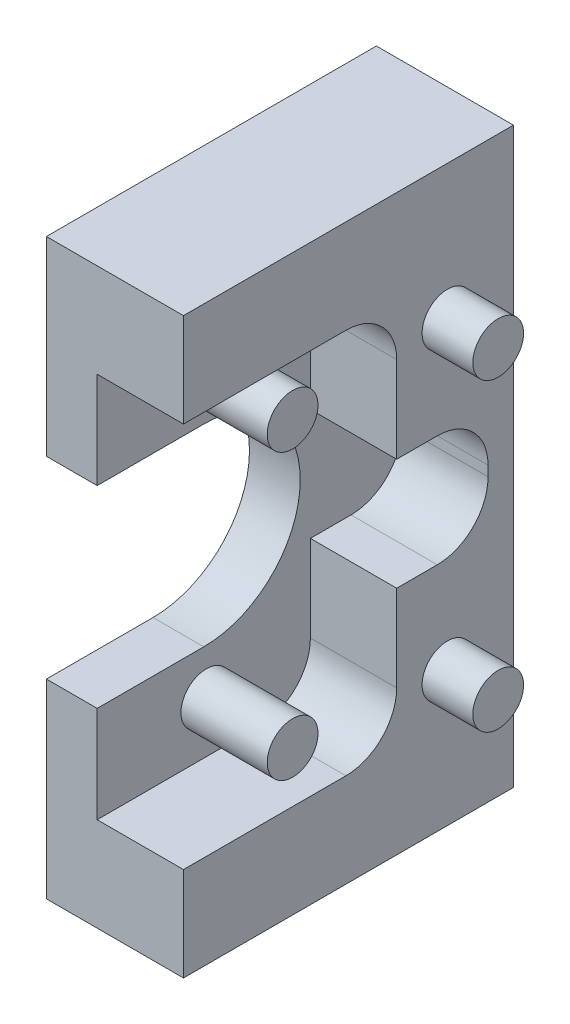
ISO-10303-21;
HEADER;
FILE_DESCRIPTION(('STEP AP214'),'2;1');
FILE_NAME('part.step','',(''),(''),'','','');
FILE_SCHEMA(('AUTOMOTIVE_DESIGN { 1 0 10303 214 1 1 1 1 }'));
ENDSEC;
DATA;
#1=APPLICATION_CONTEXT('core data for automotive mechanical design processes');
#2=APPLICATION_PROTOCOL_DEFINITION('international standard','automotive_design',2000,#1);
#3=PRODUCT_CONTEXT('',#1,'mechanical');
#4=PRODUCT('Part','Part','',(#3));
#5=PRODUCT_RELATED_PRODUCT_CATEGORY('part','',(#4));
#6=PRODUCT_DEFINITION_FORMATION('','',#4);
#7=PRODUCT_DEFINITION_CONTEXT('part definition',#1,'design');
#8=PRODUCT_DEFINITION('design','',#6,#7);
#9=PRODUCT_DEFINITION_SHAPE('','',#8);
#10=(LENGTH_UNIT() NAMED_UNIT(*) SI_UNIT(.MILLI.,.METRE.));
#11=(NAMED_UNIT(*) PLANE_ANGLE_UNIT() SI_UNIT($,.RADIAN.));
#12=(NAMED_UNIT(*) SI_UNIT($,.STERADIAN.) SOLID_ANGLE_UNIT());
#13=UNCERTAINTY_MEASURE_WITH_UNIT(LENGTH_MEASURE(1.E-05),#10,'distance_accuracy_value','');
#14=(GEOMETRIC_REPRESENTATION_CONTEXT(3) GLOBAL_UNCERTAINTY_ASSIGNED_CONTEXT((#13)) GLOBAL_UNIT_ASSIGNED_CONTEXT((#10,
#11,#12)) REPRESENTATION_CONTEXT('',''));
#15=CARTESIAN_POINT('',(0.,0.,0.));
#16=DIRECTION('',(0.,0.,1.));
#17=DIRECTION('',(1.,0.,0.));
#18=AXIS2_PLACEMENT_3D('',#15,#16,#17);
#19=CARTESIAN_POINT('',(0.,28.,0.500000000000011));
#20=DIRECTION('',(1.,0.,0.));
#21=DIRECTION('',(0.,0.,-1.));
#22=AXIS2_PLACEMENT_3D('',#19,#20,#21);
#23=PLANE('',#22);
#24=CARTESIAN_POINT('',(-1.95590071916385E-13,56.,0.));
#25=DIRECTION('',(1.,0.,0.));
#26=DIRECTION('',(0.,0.,-1.));
#27=AXIS2_PLACEMENT_3D('',#24,#25,#26);
#28=CIRCLE('',#27,5.);
#29=CARTESIAN_POINT('',(-2.13047478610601E-13,56.,-4.99999999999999));
#30=VERTEX_POINT('',#29);
#31=EDGE_CURVE('E452',#30,#30,#28,.T.);
#32=ORIENTED_EDGE('',*,*,#31,.F.);
#33=EDGE_LOOP('',(#32));
#34=FACE_BOUND('',#33,.T.);
#35=CARTESIAN_POINT('',(0.,0.,0.));
#36=DIRECTION('',(1.,0.,0.));
#37=DIRECTION('',(0.,0.,-1.));
#38=AXIS2_PLACEMENT_3D('',#35,#36,#37);
#39=CIRCLE('',#38,5.);
#40=CARTESIAN_POINT('',(0.,0.,-4.99999999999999));
#41=VERTEX_POINT('',#40);
#42=EDGE_CURVE('E455',#41,#41,#39,.T.);
#43=ORIENTED_EDGE('',*,*,#42,.F.);
#44=EDGE_LOOP('',(#43));
#45=FACE_BOUND('',#44,.T.);
#46=DIRECTION('',(0.,0.,-1.));
#47=VECTOR('',#46,1.);
#48=CARTESIAN_POINT('',(1.0993810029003E-13,-10.,21.5));
#49=LINE('',#48,#47);
#50=CARTESIAN_POINT('',(1.0993810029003E-13,-10.,21.5));
#51=VERTEX_POINT('',#50);
#52=CARTESIAN_POINT('',(0.,-10.,-10.5));
#53=VERTEX_POINT('',#52);
#54=EDGE_CURVE('E465',#51,#53,#49,.T.);
#55=ORIENTED_EDGE('',*,*,#54,.T.);
#56=CARTESIAN_POINT('',(0.,0.,-10.5));
#57=DIRECTION('',(1.,0.,0.));
#58=DIRECTION('',(0.,0.,-1.));
#59=AXIS2_PLACEMENT_3D('',#56,#57,#58);
#60=CIRCLE('',#59,10.);
#61=CARTESIAN_POINT('',(0.,0.,-20.5));
#62=VERTEX_POINT('',#61);
#63=EDGE_CURVE('E468',#53,#62,#60,.T.);
#64=ORIENTED_EDGE('',*,*,#63,.T.);
#65=DIRECTION('',(0.,1.,0.));
#66=VECTOR('',#65,1.);
#67=CARTESIAN_POINT('',(0.,0.,-20.5));
#68=LINE('',#67,#66);
#69=CARTESIAN_POINT('',(-1.30971622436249E-13,17.,-20.5));
#70=VERTEX_POINT('',#69);
#71=EDGE_CURVE('E471',#62,#70,#68,.T.);
#72=ORIENTED_EDGE('',*,*,#71,.T.);
#73=DIRECTION('',(0.,0.,-1.));
#74=VECTOR('',#73,1.);
#75=CARTESIAN_POINT('',(-1.30971622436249E-13,17.,-20.5));
#76=LINE('',#75,#74);
#77=CARTESIAN_POINT('',(-1.58944038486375E-13,17.,-28.5));
#78=VERTEX_POINT('',#77);
#79=EDGE_CURVE('E474',#70,#78,#76,.T.);
#80=ORIENTED_EDGE('',*,*,#79,.T.);
#81=CARTESIAN_POINT('',(-1.93855348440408E-13,27.,-28.5));
#82=DIRECTION('',(1.,0.,0.));
#83=DIRECTION('',(0.,0.,-1.));
#84=AXIS2_PLACEMENT_3D('',#81,#82,#83);
#85=CIRCLE('',#84,10.);
#86=CARTESIAN_POINT('',(-2.28766658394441E-13,27.,-38.5));
#87=VERTEX_POINT('',#86);
#88=EDGE_CURVE('E477',#78,#87,#85,.T.);
#89=ORIENTED_EDGE('',*,*,#88,.T.);
#90=DIRECTION('',(0.,1.,0.));
#91=VECTOR('',#90,1.);
#92=CARTESIAN_POINT('',(-2.28766658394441E-13,27.,-38.5));
#93=LINE('',#92,#91);
#94=CARTESIAN_POINT('',(-2.35705552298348E-13,29.,-38.5));
#95=VERTEX_POINT('',#94);
#96=EDGE_CURVE('E480',#87,#95,#93,.T.);
#97=ORIENTED_EDGE('',*,*,#96,.T.);
#98=CARTESIAN_POINT('',(-2.00794242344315E-13,29.,-28.5));
#99=DIRECTION('',(1.,0.,0.));
#100=DIRECTION('',(0.,0.,-1.));
#101=AXIS2_PLACEMENT_3D('',#98,#99,#100);
#102=CIRCLE('',#101,10.);
#103=CARTESIAN_POINT('',(-2.35705552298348E-13,39.,-28.5));
#104=VERTEX_POINT('',#103);
#105=EDGE_CURVE('E483',#95,#104,#102,.T.);
#106=ORIENTED_EDGE('',*,*,#105,.T.);
#107=DIRECTION('',(0.,0.,1.));
#108=VECTOR('',#107,1.);
#109=CARTESIAN_POINT('',(-2.35705552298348E-13,39.,-28.5));
#110=LINE('',#109,#108);
#111=CARTESIAN_POINT('',(-2.07733136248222E-13,39.,-20.5));
#112=VERTEX_POINT('',#111);
#113=EDGE_CURVE('E486',#104,#112,#110,.T.);
#114=ORIENTED_EDGE('',*,*,#113,.T.);
#115=DIRECTION('',(0.,1.,0.));
#116=VECTOR('',#115,1.);
#117=CARTESIAN_POINT('',(-2.07733136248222E-13,39.,-20.5));
#118=LINE('',#117,#116);
#119=CARTESIAN_POINT('',(-2.67147415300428E-13,56.,-20.5));
#120=VERTEX_POINT('',#119);
#121=EDGE_CURVE('E489',#112,#120,#118,.T.);
#122=ORIENTED_EDGE('',*,*,#121,.T.);
#123=CARTESIAN_POINT('',(-2.32236105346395E-13,56.,-10.5));
#124=DIRECTION('',(1.,0.,0.));
#125=DIRECTION('',(0.,0.,-1.));
#126=AXIS2_PLACEMENT_3D('',#123,#124,#125);
#127=CIRCLE('',#126,10.);
#128=CARTESIAN_POINT('',(-2.67147415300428E-13,66.,-10.5));
#129=VERTEX_POINT('',#128);
#130=EDGE_CURVE('E492',#120,#129,#127,.T.);
#131=ORIENTED_EDGE('',*,*,#130,.T.);
#132=DIRECTION('',(0.,0.,1.));
#133=VECTOR('',#132,1.);
#134=CARTESIAN_POINT('',(-2.67147415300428E-13,66.,-10.5));
#135=LINE('',#134,#133);
#136=CARTESIAN_POINT('',(-1.55257751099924E-13,66.,21.5));
#137=VERTEX_POINT('',#136);
#138=EDGE_CURVE('E495',#129,#137,#135,.T.);
#139=ORIENTED_EDGE('',*,*,#138,.T.);
#140=DIRECTION('',(0.,-1.,0.));
#141=VECTOR('',#140,1.);
#142=CARTESIAN_POINT('',(-1.55257751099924E-13,66.,21.5));
#143=LINE('',#142,#141);
#144=CARTESIAN_POINT('',(0.,47.,21.5));
#145=VERTEX_POINT('',#144);
#146=EDGE_CURVE('E498',#137,#145,#143,.T.);
#147=ORIENTED_EDGE('',*,*,#146,.T.);
#148=DIRECTION('',(0.,0.,-1.));
#149=VECTOR('',#148,1.);
#150=CARTESIAN_POINT('',(0.,47.,21.5));
#151=LINE('',#150,#149);
#152=CARTESIAN_POINT('',(-1.62413485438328E-13,47.,0.500000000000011));
#153=VERTEX_POINT('',#152);
#154=EDGE_CURVE('E500',#145,#153,#151,.T.);
#155=ORIENTED_EDGE('',*,*,#154,.T.);
#156=CARTESIAN_POINT('',(0.,28.,0.500000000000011));
#157=DIRECTION('',(-1.,0.,0.));
#158=DIRECTION('',(0.,0.,-1.));
#159=AXIS2_PLACEMENT_3D('',#156,#157,#158);
#160=CIRCLE('',#159,19.);
#161=CARTESIAN_POINT('',(0.,9.,0.500000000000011));
#162=VERTEX_POINT('',#161);
#163=EDGE_CURVE('E458',#153,#162,#160,.T.);
#164=ORIENTED_EDGE('',*,*,#163,.T.);
#165=DIRECTION('',(0.,0.,1.));
#166=VECTOR('',#165,1.);
#167=CARTESIAN_POINT('',(0.,9.,0.500000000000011));
#168=LINE('',#167,#166);
#169=CARTESIAN_POINT('',(0.,9.,21.5));
#170=VERTEX_POINT('',#169);
#171=EDGE_CURVE('E460',#162,#170,#168,.T.);
#172=ORIENTED_EDGE('',*,*,#171,.T.);
#173=DIRECTION('',(0.,-1.,0.));
#174=VECTOR('',#173,1.);
#175=CARTESIAN_POINT('',(0.,9.,21.5));
#176=LINE('',#175,#174);
#177=EDGE_CURVE('E462',#170,#51,#176,.T.);
#178=ORIENTED_EDGE('',*,*,#177,.T.);
#179=EDGE_LOOP('',(#55,#64,#72,#80,#89,#97,#106,#114,#122,#131,#139,#147,#155,#164,#172,#178));
#180=FACE_BOUND('',#179,.T.);
#181=ADVANCED_FACE('F14',(#34,#45,#180),#23,.T.);
#182=CARTESIAN_POINT('',(-10.,28.,0.500000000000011));
#183=DIRECTION('',(-1.,0.,0.));
#184=DIRECTION('',(0.,0.,1.));
#185=AXIS2_PLACEMENT_3D('',#182,#183,#184);
#186=PLANE('',#185);
#187=CARTESIAN_POINT('',(-10.,-2.,-30.5));
#188=DIRECTION('',(-1.,0.,0.));
#189=DIRECTION('',(0.,0.,1.));
#190=AXIS2_PLACEMENT_3D('',#187,#188,#189);
#191=CIRCLE('',#190,8.5);
#192=CARTESIAN_POINT('',(-9.99999999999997,-2.,-22.));
#193=VERTEX_POINT('',#192);
#194=EDGE_CURVE('E417',#193,#193,#191,.T.);
#195=ORIENTED_EDGE('',*,*,#194,.F.);
#196=EDGE_LOOP('',(#195));
#197=FACE_BOUND('',#196,.T.);
#198=CARTESIAN_POINT('',(-10.0000000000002,58.,-30.5));
#199=DIRECTION('',(-1.,0.,0.));
#200=DIRECTION('',(0.,0.,1.));
#201=AXIS2_PLACEMENT_3D('',#198,#199,#200);
#202=CIRCLE('',#201,8.5);
#203=CARTESIAN_POINT('',(-10.0000000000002,58.,-22.));
#204=VERTEX_POINT('',#203);
#205=EDGE_CURVE('E409',#204,#204,#202,.T.);
#206=ORIENTED_EDGE('',*,*,#205,.F.);
#207=EDGE_LOOP('',(#206));
#208=FACE_BOUND('',#207,.T.);
#209=DIRECTION('',(0.,1.,0.));
#210=VECTOR('',#209,1.);
#211=CARTESIAN_POINT('',(-9.99999999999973,-28.5,21.5));
#212=LINE('',#211,#210);
#213=CARTESIAN_POINT('',(-9.99999999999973,-28.5,21.5));
#214=VERTEX_POINT('',#213);
#215=CARTESIAN_POINT('',(-9.99999999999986,9.,21.5));
#216=VERTEX_POINT('',#215);
#217=EDGE_CURVE('E428',#214,#216,#212,.T.);
#218=ORIENTED_EDGE('',*,*,#217,.T.);
#219=DIRECTION('',(0.,0.,-1.));
#220=VECTOR('',#219,1.);
#221=CARTESIAN_POINT('',(-9.99999999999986,9.,21.5));
#222=LINE('',#221,#220);
#223=CARTESIAN_POINT('',(-10.,9.,0.500000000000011));
#224=VERTEX_POINT('',#223);
#225=EDGE_CURVE('E431',#216,#224,#222,.T.);
#226=ORIENTED_EDGE('',*,*,#225,.T.);
#227=CARTESIAN_POINT('',(-10.,28.,0.500000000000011));
#228=DIRECTION('',(1.,0.,0.));
#229=DIRECTION('',(0.,0.,1.));
#230=AXIS2_PLACEMENT_3D('',#227,#228,#229);
#231=CIRCLE('',#230,19.);
#232=CARTESIAN_POINT('',(-10.,47.,0.500000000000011));
#233=VERTEX_POINT('',#232);
#234=EDGE_CURVE('E434',#224,#233,#231,.T.);
#235=ORIENTED_EDGE('',*,*,#234,.T.);
#236=DIRECTION('',(0.,0.,1.));
#237=VECTOR('',#236,1.);
#238=CARTESIAN_POINT('',(-10.,47.,0.500000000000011));
#239=LINE('',#238,#237);
#240=CARTESIAN_POINT('',(-10.,47.,21.5));
#241=VERTEX_POINT('',#240);
#242=EDGE_CURVE('E437',#233,#241,#239,.T.);
#243=ORIENTED_EDGE('',*,*,#242,.T.);
#244=DIRECTION('',(0.,1.,0.));
#245=VECTOR('',#244,1.);
#246=CARTESIAN_POINT('',(-10.,47.,21.5));
#247=LINE('',#246,#245);
#248=CARTESIAN_POINT('',(-10.0000000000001,84.5,21.5));
#249=VERTEX_POINT('',#248);
#250=EDGE_CURVE('E440',#241,#249,#247,.T.);
#251=ORIENTED_EDGE('',*,*,#250,.T.);
#252=DIRECTION('',(0.,0.,-1.));
#253=VECTOR('',#252,1.);
#254=CARTESIAN_POINT('',(-10.0000000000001,84.5,21.5));
#255=LINE('',#254,#253);
#256=CARTESIAN_POINT('',(-10.0000000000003,84.5,-43.5));
#257=VERTEX_POINT('',#256);
#258=EDGE_CURVE('E443',#249,#257,#255,.T.);
#259=ORIENTED_EDGE('',*,*,#258,.T.);
#260=DIRECTION('',(0.,-1.,0.));
#261=VECTOR('',#260,1.);
#262=CARTESIAN_POINT('',(-10.0000000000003,84.5,-43.5));
#263=LINE('',#262,#261);
#264=CARTESIAN_POINT('',(-10.,-28.5,-43.5));
#265=VERTEX_POINT('',#264);
#266=EDGE_CURVE('E446',#257,#265,#263,.T.);
#267=ORIENTED_EDGE('',*,*,#266,.T.);
#268=DIRECTION('',(0.,0.,1.));
#269=VECTOR('',#268,1.);
#270=CARTESIAN_POINT('',(-10.,-28.5,-43.5));
#271=LINE('',#270,#269);
#272=EDGE_CURVE('E449',#265,#214,#271,.T.);
#273=ORIENTED_EDGE('',*,*,#272,.T.);
#274=EDGE_LOOP('',(#218,#226,#235,#243,#251,#259,#267,#273));
#275=FACE_BOUND('',#274,.T.);
#276=CARTESIAN_POINT('',(-10.,0.,0.));
#277=DIRECTION('',(-1.,0.,0.));
#278=DIRECTION('',(0.,0.,1.));
#279=AXIS2_PLACEMENT_3D('',#276,#277,#278);
#280=CIRCLE('',#279,8.5);
#281=CARTESIAN_POINT('',(-9.99999999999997,0.,8.50000000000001));
#282=VERTEX_POINT('',#281);
#283=EDGE_CURVE('E425',#282,#282,#280,.T.);
#284=ORIENTED_EDGE('',*,*,#283,.F.);
#285=EDGE_LOOP('',(#284));
#286=FACE_BOUND('',#285,.T.);
#287=CARTESIAN_POINT('',(-10.,56.,0.));
#288=DIRECTION('',(-1.,0.,0.));
#289=DIRECTION('',(0.,0.,1.));
#290=AXIS2_PLACEMENT_3D('',#287,#288,#289);
#291=CIRCLE('',#290,8.5);
#292=CARTESIAN_POINT('',(-9.99999999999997,56.,8.50000000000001));
#293=VERTEX_POINT('',#292);
#294=EDGE_CURVE('E420',#293,#293,#291,.T.);
#295=ORIENTED_EDGE('',*,*,#294,.F.);
#296=EDGE_LOOP('',(#295));
#297=FACE_BOUND('',#296,.T.);
#298=ADVANCED_FACE('F839',(#197,#208,#275,#286,#297),#186,.T.);
#299=CARTESIAN_POINT('',(-4.885,-6.92820323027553,4.));
#300=DIRECTION('',(1.,0.,0.));
#301=DIRECTION('',(0.,-0.5,0.866025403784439));
#302=AXIS2_PLACEMENT_3D('',#299,#300,#301);
#303=PLANE('',#302);
#304=DIRECTION('',(0.,0.5,-0.866025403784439));
#305=VECTOR('',#304,1.);
#306=CARTESIAN_POINT('',(-4.885,2.30940107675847,4.));
#307=LINE('',#306,#305);
#308=CARTESIAN_POINT('',(-4.885,2.30940107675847,4.));
#309=VERTEX_POINT('',#308);
#310=CARTESIAN_POINT('',(-4.885,4.61880215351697,0.));
#311=VERTEX_POINT('',#310);
#312=EDGE_CURVE('E604',#309,#311,#307,.T.);
#313=ORIENTED_EDGE('',*,*,#312,.T.);
#314=DIRECTION('',(0.,-0.5,-0.866025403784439));
#315=VECTOR('',#314,1.);
#316=CARTESIAN_POINT('',(-4.885,4.61880215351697,0.));
#317=LINE('',#316,#315);
#318=CARTESIAN_POINT('',(-4.885,2.30940107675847,-4.));
#319=VERTEX_POINT('',#318);
#320=EDGE_CURVE('E599',#311,#319,#317,.T.);
#321=ORIENTED_EDGE('',*,*,#320,.T.);
#322=DIRECTION('',(0.,1.,0.));
#323=VECTOR('',#322,1.);
#324=CARTESIAN_POINT('',(-4.885,-2.30940107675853,-4.));
#325=LINE('',#324,#323);
#326=CARTESIAN_POINT('',(-4.885,-2.30940107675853,-4.));
#327=VERTEX_POINT('',#326);
#328=EDGE_CURVE('E596',#327,#319,#325,.T.);
#329=ORIENTED_EDGE('',*,*,#328,.F.);
#330=DIRECTION('',(0.,0.5,-0.866025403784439));
#331=VECTOR('',#330,1.);
#332=CARTESIAN_POINT('',(-4.885,-4.61880215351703,0.));
#333=LINE('',#332,#331);
#334=CARTESIAN_POINT('',(-4.885,-4.61880215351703,0.));
#335=VERTEX_POINT('',#334);
#336=EDGE_CURVE('E590',#335,#327,#333,.T.);
#337=ORIENTED_EDGE('',*,*,#336,.F.);
#338=DIRECTION('',(0.,0.5,0.866025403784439));
#339=VECTOR('',#338,1.);
#340=CARTESIAN_POINT('',(-4.885,-4.61880215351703,0.));
#341=LINE('',#340,#339);
#342=CARTESIAN_POINT('',(-4.885,-2.30940107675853,4.));
#343=VERTEX_POINT('',#342);
#344=EDGE_CURVE('E582',#335,#343,#341,.T.);
#345=ORIENTED_EDGE('',*,*,#344,.T.);
#346=DIRECTION('',(0.,-1.,0.));
#347=VECTOR('',#346,1.);
#348=CARTESIAN_POINT('',(-4.885,2.30940107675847,4.));
#349=LINE('',#348,#347);
#350=EDGE_CURVE('E576',#309,#343,#349,.T.);
#351=ORIENTED_EDGE('',*,*,#350,.F.);
#352=EDGE_LOOP('',(#313,#321,#329,#337,#345,#351));
#353=FACE_BOUND('',#352,.T.);
#354=ADVANCED_FACE('F880',(#353),#303,.F.);
#355=CARTESIAN_POINT('',(-4.885,2.30940107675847,4.));
#356=DIRECTION('',(0.,0.,-1.));
#357=DIRECTION('',(0.,-1.,0.));
#358=AXIS2_PLACEMENT_3D('',#355,#356,#357);
#359=PLANE('',#358);
#360=ORIENTED_EDGE('',*,*,#350,.T.);
#361=DIRECTION('',(-1.,0.,0.));
#362=VECTOR('',#361,1.);
#363=CARTESIAN_POINT('',(-4.885,-2.30940107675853,4.));
#364=LINE('',#363,#362);
#365=CARTESIAN_POINT('',(-9.5,-2.30940107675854,4.));
#366=VERTEX_POINT('',#365);
#367=EDGE_CURVE('E573',#343,#366,#364,.T.);
#368=ORIENTED_EDGE('',*,*,#367,.T.);
#369=DIRECTION('',(0.,1.,0.));
#370=VECTOR('',#369,1.);
#371=CARTESIAN_POINT('',(-9.5,-2.30940107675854,4.));
#372=LINE('',#371,#370);
#373=CARTESIAN_POINT('',(-9.5,2.30940107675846,4.));
#374=VERTEX_POINT('',#373);
#375=EDGE_CURVE('E559',#366,#374,#372,.T.);
#376=ORIENTED_EDGE('',*,*,#375,.T.);
#377=DIRECTION('',(-1.,0.,0.));
#378=VECTOR('',#377,1.);
#379=CARTESIAN_POINT('',(-4.885,2.30940107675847,4.));
#380=LINE('',#379,#378);
#381=EDGE_CURVE('E579',#374,#309,#380,.F.);
#382=ORIENTED_EDGE('',*,*,#381,.T.);
#383=EDGE_LOOP('',(#360,#368,#376,#382));
#384=FACE_BOUND('',#383,.T.);
#385=ADVANCED_FACE('F933',(#384),#359,.T.);
#386=CARTESIAN_POINT('',(-4.885,2.30940107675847,4.));
#387=DIRECTION('',(0.,0.866025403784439,0.5));
#388=DIRECTION('',(0.,0.5,-0.866025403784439));
#389=AXIS2_PLACEMENT_3D('',#386,#387,#388);
#390=PLANE('',#389);
#391=DIRECTION('',(-1.,0.,0.));
#392=VECTOR('',#391,1.);
#393=CARTESIAN_POINT('',(-4.885,4.61880215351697,0.));
#394=LINE('',#393,#392);
#395=CARTESIAN_POINT('',(-9.5,4.61880215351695,0.));
#396=VERTEX_POINT('',#395);
#397=EDGE_CURVE('E601',#396,#311,#394,.F.);
#398=ORIENTED_EDGE('',*,*,#397,.T.);
#399=ORIENTED_EDGE('',*,*,#312,.F.);
#400=ORIENTED_EDGE('',*,*,#381,.F.);
#401=DIRECTION('',(0.,-0.5,0.866025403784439));
#402=VECTOR('',#401,1.);
#403=CARTESIAN_POINT('',(-9.5,3.46410161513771,2.));
#404=LINE('',#403,#402);
#405=EDGE_CURVE('E571',#374,#396,#404,.F.);
#406=ORIENTED_EDGE('',*,*,#405,.T.);
#407=EDGE_LOOP('',(#398,#399,#400,#406));
#408=FACE_BOUND('',#407,.T.);
#409=ADVANCED_FACE('F936',(#408),#390,.F.);
#410=CARTESIAN_POINT('',(-4.885,4.61880215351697,0.));
#411=DIRECTION('',(0.,0.866025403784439,-0.5));
#412=DIRECTION('',(0.,-0.5,-0.866025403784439));
#413=AXIS2_PLACEMENT_3D('',#410,#411,#412);
#414=PLANE('',#413);
#415=DIRECTION('',(-1.,0.,0.));
#416=VECTOR('',#415,1.);
#417=CARTESIAN_POINT('',(-4.885,2.30940107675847,-4.));
#418=LINE('',#417,#416);
#419=CARTESIAN_POINT('',(-9.5,2.30940107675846,-4.));
#420=VERTEX_POINT('',#419);
#421=EDGE_CURVE('E593',#319,#420,#418,.T.);
#422=ORIENTED_EDGE('',*,*,#421,.F.);
#423=ORIENTED_EDGE('',*,*,#320,.F.);
#424=ORIENTED_EDGE('',*,*,#397,.F.);
#425=DIRECTION('',(0.,-0.5,-0.866025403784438));
#426=VECTOR('',#425,1.);
#427=CARTESIAN_POINT('',(-9.5,4.61880215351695,0.));
#428=LINE('',#427,#426);
#429=EDGE_CURVE('E569',#396,#420,#428,.T.);
#430=ORIENTED_EDGE('',*,*,#429,.T.);
#431=EDGE_LOOP('',(#422,#423,#424,#430));
#432=FACE_BOUND('',#431,.T.);
#433=ADVANCED_FACE('F950',(#432),#414,.F.);
#434=CARTESIAN_POINT('',(-4.885,-2.30940107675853,-4.));
#435=DIRECTION('',(0.,0.,1.));
#436=DIRECTION('',(0.,1.,0.));
#437=AXIS2_PLACEMENT_3D('',#434,#435,#436);
#438=PLANE('',#437);
#439=ORIENTED_EDGE('',*,*,#328,.T.);
#440=ORIENTED_EDGE('',*,*,#421,.T.);
#441=DIRECTION('',(0.,-1.,0.));
#442=VECTOR('',#441,1.);
#443=CARTESIAN_POINT('',(-9.5,2.30940107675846,-4.));
#444=LINE('',#443,#442);
#445=CARTESIAN_POINT('',(-9.5,-2.30940107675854,-4.));
#446=VERTEX_POINT('',#445);
#447=EDGE_CURVE('E567',#420,#446,#444,.T.);
#448=ORIENTED_EDGE('',*,*,#447,.T.);
#449=DIRECTION('',(-1.,0.,0.));
#450=VECTOR('',#449,1.);
#451=CARTESIAN_POINT('',(-4.885,-2.30940107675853,-4.));
#452=LINE('',#451,#450);
#453=EDGE_CURVE('E587',#327,#446,#452,.T.);
#454=ORIENTED_EDGE('',*,*,#453,.F.);
#455=EDGE_LOOP('',(#439,#440,#448,#454));
#456=FACE_BOUND('',#455,.T.);
#457=ADVANCED_FACE('F946',(#456),#438,.T.);
#458=CARTESIAN_POINT('',(-4.885,-4.61880215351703,0.));
#459=DIRECTION('',(0.,0.866025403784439,0.5));
#460=DIRECTION('',(0.,0.5,-0.866025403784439));
#461=AXIS2_PLACEMENT_3D('',#458,#459,#460);
#462=PLANE('',#461);
#463=ORIENTED_EDGE('',*,*,#336,.T.);
#464=ORIENTED_EDGE('',*,*,#453,.T.);
#465=DIRECTION('',(0.,-0.5,0.866025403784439));
#466=VECTOR('',#465,1.);
#467=CARTESIAN_POINT('',(-9.5,-3.4641016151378,-2.));
#468=LINE('',#467,#466);
#469=CARTESIAN_POINT('',(-9.5,-4.61880215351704,0.));
#470=VERTEX_POINT('',#469);
#471=EDGE_CURVE('E565',#446,#470,#468,.T.);
#472=ORIENTED_EDGE('',*,*,#471,.T.);
#473=DIRECTION('',(-1.,0.,0.));
#474=VECTOR('',#473,1.);
#475=CARTESIAN_POINT('',(-4.885,-4.61880215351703,0.));
#476=LINE('',#475,#474);
#477=EDGE_CURVE('E584',#470,#335,#476,.F.);
#478=ORIENTED_EDGE('',*,*,#477,.T.);
#479=EDGE_LOOP('',(#463,#464,#472,#478));
#480=FACE_BOUND('',#479,.T.);
#481=ADVANCED_FACE('F942',(#480),#462,.T.);
#482=CARTESIAN_POINT('',(-4.885,-4.61880215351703,0.));
#483=DIRECTION('',(0.,-0.866025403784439,0.5));
#484=DIRECTION('',(0.,0.5,0.866025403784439));
#485=AXIS2_PLACEMENT_3D('',#482,#483,#484);
#486=PLANE('',#485);
#487=ORIENTED_EDGE('',*,*,#367,.F.);
#488=ORIENTED_EDGE('',*,*,#344,.F.);
#489=ORIENTED_EDGE('',*,*,#477,.F.);
#490=DIRECTION('',(0.,0.5,0.866025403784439));
#491=VECTOR('',#490,1.);
#492=CARTESIAN_POINT('',(-9.5,-4.61880215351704,0.));
#493=LINE('',#492,#491);
#494=EDGE_CURVE('E563',#470,#366,#493,.T.);
#495=ORIENTED_EDGE('',*,*,#494,.T.);
#496=EDGE_LOOP('',(#487,#488,#489,#495));
#497=FACE_BOUND('',#496,.T.);
#498=ADVANCED_FACE('F938',(#497),#486,.F.);
#499=CARTESIAN_POINT('',(-9.5,-6.5817930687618,-3.8));
#500=DIRECTION('',(1.,0.,0.));
#501=DIRECTION('',(0.,-0.5,0.866025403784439));
#502=AXIS2_PLACEMENT_3D('',#499,#500,#501);
#503=PLANE('',#502);
#504=CARTESIAN_POINT('',(-9.5,0.,0.));
#505=DIRECTION('',(1.,0.,0.));
#506=DIRECTION('',(0.,-0.5,0.866025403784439));
#507=AXIS2_PLACEMENT_3D('',#504,#505,#506);
#508=CIRCLE('',#507,8.);
#509=CARTESIAN_POINT('',(-9.49999999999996,-4.00000000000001,6.92820323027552));
#510=VERTEX_POINT('',#509);
#511=EDGE_CURVE('E609',#510,#510,#508,.T.);
#512=ORIENTED_EDGE('',*,*,#511,.F.);
#513=EDGE_LOOP('',(#512));
#514=FACE_BOUND('',#513,.T.);
#515=ORIENTED_EDGE('',*,*,#494,.F.);
#516=ORIENTED_EDGE('',*,*,#471,.F.);
#517=ORIENTED_EDGE('',*,*,#447,.F.);
#518=ORIENTED_EDGE('',*,*,#429,.F.);
#519=ORIENTED_EDGE('',*,*,#405,.F.);
#520=ORIENTED_EDGE('',*,*,#375,.F.);
#521=EDGE_LOOP('',(#515,#516,#517,#518,#519,#520));
#522=FACE_BOUND('',#521,.T.);
#523=ADVANCED_FACE('F941',(#514,#522),#503,.F.);
#524=CARTESIAN_POINT('',(-3.00000000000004,0.,0.));
#525=DIRECTION('',(-1.,0.,0.));
#526=DIRECTION('',(0.,0.5,-0.866025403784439));
#527=AXIS2_PLACEMENT_3D('',#524,#525,#526);
#528=CYLINDRICAL_SURFACE('',#527,8.);
#529=CARTESIAN_POINT('',(-3.00000000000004,0.,0.));
#530=DIRECTION('',(-1.,0.,0.));
#531=DIRECTION('',(0.,0.5,-0.866025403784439));
#532=AXIS2_PLACEMENT_3D('',#529,#530,#531);
#533=CIRCLE('',#532,8.);
#534=CARTESIAN_POINT('',(-3.00000000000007,3.99999999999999,-6.9282032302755));
#535=VERTEX_POINT('',#534);
#536=EDGE_CURVE('E562',#535,#535,#533,.T.);
#537=ORIENTED_EDGE('',*,*,#536,.T.);
#538=EDGE_LOOP('',(#537));
#539=FACE_BOUND('',#538,.T.);
#540=ORIENTED_EDGE('',*,*,#511,.T.);
#541=EDGE_LOOP('',(#540));
#542=FACE_BOUND('',#541,.T.);
#543=ADVANCED_FACE('F963',(#539,#542),#528,.T.);
#544=CARTESIAN_POINT('',(-3.00000000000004,5.25,0.));
#545=DIRECTION('',(1.,0.,0.));
#546=DIRECTION('',(0.,1.,0.));
#547=AXIS2_PLACEMENT_3D('',#544,#545,#546);
#548=PLANE('',#547);
#549=ORIENTED_EDGE('',*,*,#536,.F.);
#550=EDGE_LOOP('',(#549));
#551=FACE_BOUND('',#550,.T.);
#552=CARTESIAN_POINT('',(-3.00000000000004,0.,0.));
#553=DIRECTION('',(-1.,0.,0.));
#554=DIRECTION('',(0.,-1.,0.));
#555=AXIS2_PLACEMENT_3D('',#552,#553,#554);
#556=CIRCLE('',#555,8.5);
#557=CARTESIAN_POINT('',(-3.00000000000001,-8.50000000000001,0.));
#558=VERTEX_POINT('',#557);
#559=EDGE_CURVE('E618',#558,#558,#556,.T.);
#560=ORIENTED_EDGE('',*,*,#559,.T.);
#561=EDGE_LOOP('',(#560));
#562=FACE_BOUND('',#561,.T.);
#563=ADVANCED_FACE('F967',(#551,#562),#548,.F.);
#564=CARTESIAN_POINT('',(-9.,0.,0.));
#565=DIRECTION('',(-1.,0.,0.));
#566=DIRECTION('',(0.,-1.,0.));
#567=AXIS2_PLACEMENT_3D('',#564,#565,#566);
#568=CYLINDRICAL_SURFACE('',#567,8.5);
#569=ORIENTED_EDGE('',*,*,#559,.F.);
#570=EDGE_LOOP('',(#569));
#571=FACE_BOUND('',#570,.T.);
#572=ORIENTED_EDGE('',*,*,#283,.T.);
#573=EDGE_LOOP('',(#572));
#574=FACE_BOUND('',#573,.T.);
#575=ADVANCED_FACE('F971',(#571,#574),#568,.F.);
#576=CARTESIAN_POINT('',(17.,0.,0.));
#577=DIRECTION('',(-1.,0.,0.));
#578=DIRECTION('',(0.,0.5,-0.866025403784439));
#579=AXIS2_PLACEMENT_3D('',#576,#577,#578);
#580=PLANE('',#579);
#581=CARTESIAN_POINT('',(17.,0.,0.));
#582=DIRECTION('',(-1.,0.,0.));
#583=DIRECTION('',(0.,0.5,-0.866025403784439));
#584=AXIS2_PLACEMENT_3D('',#581,#582,#583);
#585=CIRCLE('',#584,5.);
#586=CARTESIAN_POINT('',(17.,2.49999999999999,-4.33012701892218));
#587=VERTEX_POINT('',#586);
#588=EDGE_CURVE('E550',#587,#587,#585,.T.);
#589=ORIENTED_EDGE('',*,*,#588,.F.);
#590=EDGE_LOOP('',(#589));
#591=FACE_BOUND('',#590,.T.);
#592=ADVANCED_FACE('F926',(#591),#580,.F.);
#593=CARTESIAN_POINT('',(17.,56.,0.));
#594=DIRECTION('',(-1.,0.,0.));
#595=DIRECTION('',(0.,0.5,-0.866025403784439));
#596=AXIS2_PLACEMENT_3D('',#593,#594,#595);
#597=PLANE('',#596);
#598=CARTESIAN_POINT('',(17.,56.,0.));
#599=DIRECTION('',(-1.,0.,0.));
#600=DIRECTION('',(0.,0.5,-0.866025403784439));
#601=AXIS2_PLACEMENT_3D('',#598,#599,#600);
#602=CIRCLE('',#601,5.);
#603=CARTESIAN_POINT('',(17.,58.5,-4.33012701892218));
#604=VERTEX_POINT('',#603);
#605=EDGE_CURVE('E556',#604,#604,#602,.T.);
#606=ORIENTED_EDGE('',*,*,#605,.F.);
#607=EDGE_LOOP('',(#606));
#608=FACE_BOUND('',#607,.T.);
#609=ADVANCED_FACE('F872',(#608),#597,.F.);
#610=CARTESIAN_POINT('',(0.999999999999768,56.,-10.5));
#611=DIRECTION('',(1.,0.,0.));
#612=DIRECTION('',(0.,1.,0.));
#613=AXIS2_PLACEMENT_3D('',#610,#611,#612);
#614=CYLINDRICAL_SURFACE('',#613,10.);
#615=ORIENTED_EDGE('',*,*,#130,.F.);
#616=DIRECTION('',(1.,0.,0.));
#617=VECTOR('',#616,1.);
#618=CARTESIAN_POINT('',(0.999999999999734,56.,-20.5));
#619=LINE('',#618,#617);
#620=CARTESIAN_POINT('',(16.9999999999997,56.,-20.5));
#621=VERTEX_POINT('',#620);
#622=EDGE_CURVE('E633',#621,#120,#619,.F.);
#623=ORIENTED_EDGE('',*,*,#622,.F.);
#624=CARTESIAN_POINT('',(17.,56.,-10.5));
#625=DIRECTION('',(1.,0.,0.));
#626=DIRECTION('',(0.,1.,0.));
#627=AXIS2_PLACEMENT_3D('',#624,#625,#626);
#628=CIRCLE('',#627,10.);
#629=CARTESIAN_POINT('',(16.9999999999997,66.,-10.5));
#630=VERTEX_POINT('',#629);
#631=EDGE_CURVE('E801',#621,#630,#628,.T.);
#632=ORIENTED_EDGE('',*,*,#631,.T.);
#633=DIRECTION('',(1.,0.,0.));
#634=VECTOR('',#633,1.);
#635=CARTESIAN_POINT('',(0.999999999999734,66.,-10.5));
#636=LINE('',#635,#634);
#637=EDGE_CURVE('E630',#630,#129,#636,.F.);
#638=ORIENTED_EDGE('',*,*,#637,.T.);
#639=EDGE_LOOP('',(#615,#623,#632,#638));
#640=FACE_BOUND('',#639,.T.);
#641=ADVANCED_FACE('F861',(#640),#614,.F.);
#642=CARTESIAN_POINT('',(0.999999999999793,39.,-20.5));
#643=DIRECTION('',(0.,0.,-1.));
#644=DIRECTION('',(-1.,0.,0.));
#645=AXIS2_PLACEMENT_3D('',#642,#643,#644);
#646=PLANE('',#645);
#647=DIRECTION('',(-1.,0.,0.));
#648=VECTOR('',#647,1.);
#649=CARTESIAN_POINT('',(0.999999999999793,39.,-20.5));
#650=LINE('',#649,#648);
#651=CARTESIAN_POINT('',(17.,39.,-20.5));
#652=VERTEX_POINT('',#651);
#653=EDGE_CURVE('E737',#112,#652,#650,.F.);
#654=ORIENTED_EDGE('',*,*,#653,.T.);
#655=DIRECTION('',(0.,1.,0.));
#656=VECTOR('',#655,1.);
#657=CARTESIAN_POINT('',(17.,28.,-20.5));
#658=LINE('',#657,#656);
#659=EDGE_CURVE('E733',#652,#621,#658,.T.);
#660=ORIENTED_EDGE('',*,*,#659,.T.);
#661=ORIENTED_EDGE('',*,*,#622,.T.);
#662=ORIENTED_EDGE('',*,*,#121,.F.);
#663=EDGE_LOOP('',(#654,#660,#661,#662));
#664=FACE_BOUND('',#663,.T.);
#665=ADVANCED_FACE('F863',(#664),#646,.F.);
#666=CARTESIAN_POINT('',(0.999999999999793,39.,-20.5));
#667=DIRECTION('',(0.,1.,0.));
#668=DIRECTION('',(0.,0.,1.));
#669=AXIS2_PLACEMENT_3D('',#666,#667,#668);
#670=PLANE('',#669);
#671=DIRECTION('',(1.,0.,0.));
#672=VECTOR('',#671,1.);
#673=CARTESIAN_POINT('',(0.999999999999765,39.,-28.5));
#674=LINE('',#673,#672);
#675=CARTESIAN_POINT('',(17.,39.,-28.5));
#676=VERTEX_POINT('',#675);
#677=EDGE_CURVE('E636',#676,#104,#674,.F.);
#678=ORIENTED_EDGE('',*,*,#677,.F.);
#679=DIRECTION('',(0.,0.,-1.));
#680=VECTOR('',#679,1.);
#681=CARTESIAN_POINT('',(17.,39.,-20.5));
#682=LINE('',#681,#680);
#683=EDGE_CURVE('E721',#652,#676,#682,.T.);
#684=ORIENTED_EDGE('',*,*,#683,.F.);
#685=ORIENTED_EDGE('',*,*,#653,.F.);
#686=ORIENTED_EDGE('',*,*,#113,.F.);
#687=EDGE_LOOP('',(#678,#684,#685,#686));
#688=FACE_BOUND('',#687,.T.);
#689=ADVANCED_FACE('F735',(#688),#670,.F.);
#690=CARTESIAN_POINT('',(0.999999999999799,29.,-28.5));
#691=DIRECTION('',(1.,0.,0.));
#692=DIRECTION('',(0.,1.,0.));
#693=AXIS2_PLACEMENT_3D('',#690,#691,#692);
#694=CYLINDRICAL_SURFACE('',#693,10.);
#695=DIRECTION('',(1.,0.,0.));
#696=VECTOR('',#695,1.);
#697=CARTESIAN_POINT('',(0.999999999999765,29.,-38.5));
#698=LINE('',#697,#696);
#699=CARTESIAN_POINT('',(17.,29.,-38.5));
#700=VERTEX_POINT('',#699);
#701=EDGE_CURVE('E640',#700,#95,#698,.F.);
#702=ORIENTED_EDGE('',*,*,#701,.F.);
#703=CARTESIAN_POINT('',(17.,29.,-28.5));
#704=DIRECTION('',(1.,0.,0.));
#705=DIRECTION('',(0.,1.,0.));
#706=AXIS2_PLACEMENT_3D('',#703,#704,#705);
#707=CIRCLE('',#706,10.);
#708=EDGE_CURVE('E606',#700,#676,#707,.T.);
#709=ORIENTED_EDGE('',*,*,#708,.T.);
#710=ORIENTED_EDGE('',*,*,#677,.T.);
#711=ORIENTED_EDGE('',*,*,#105,.F.);
#712=EDGE_LOOP('',(#702,#709,#710,#711));
#713=FACE_BOUND('',#712,.T.);
#714=ADVANCED_FACE('F741',(#713),#694,.F.);
#715=CARTESIAN_POINT('',(0.999999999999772,27.,-38.5));
#716=DIRECTION('',(0.,0.,-1.));
#717=DIRECTION('',(-1.,0.,0.));
#718=AXIS2_PLACEMENT_3D('',#715,#716,#717);
#719=PLANE('',#718);
#720=DIRECTION('',(-1.,0.,0.));
#721=VECTOR('',#720,1.);
#722=CARTESIAN_POINT('',(0.999999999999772,27.,-38.5));
#723=LINE('',#722,#721);
#724=CARTESIAN_POINT('',(17.,27.,-38.5));
#725=VERTEX_POINT('',#724);
#726=EDGE_CURVE('E644',#725,#87,#723,.T.);
#727=ORIENTED_EDGE('',*,*,#726,.F.);
#728=DIRECTION('',(0.,1.,0.));
#729=VECTOR('',#728,1.);
#730=CARTESIAN_POINT('',(17.,28.,-38.5));
#731=LINE('',#730,#729);
#732=EDGE_CURVE('E706',#725,#700,#731,.T.);
#733=ORIENTED_EDGE('',*,*,#732,.T.);
#734=ORIENTED_EDGE('',*,*,#701,.T.);
#735=ORIENTED_EDGE('',*,*,#96,.F.);
#736=EDGE_LOOP('',(#727,#733,#734,#735));
#737=FACE_BOUND('',#736,.T.);
#738=ADVANCED_FACE('F744',(#737),#719,.F.);
#739=CARTESIAN_POINT('',(0.999999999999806,27.,-28.5));
#740=DIRECTION('',(1.,0.,0.));
#741=DIRECTION('',(0.,1.,0.));
#742=AXIS2_PLACEMENT_3D('',#739,#740,#741);
#743=CYLINDRICAL_SURFACE('',#742,10.);
#744=DIRECTION('',(1.,0.,0.));
#745=VECTOR('',#744,1.);
#746=CARTESIAN_POINT('',(0.999999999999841,17.,-28.5));
#747=LINE('',#746,#745);
#748=CARTESIAN_POINT('',(17.,17.,-28.5));
#749=VERTEX_POINT('',#748);
#750=EDGE_CURVE('E648',#749,#78,#747,.F.);
#751=ORIENTED_EDGE('',*,*,#750,.F.);
#752=CARTESIAN_POINT('',(17.,27.,-28.5));
#753=DIRECTION('',(1.,0.,0.));
#754=DIRECTION('',(0.,1.,0.));
#755=AXIS2_PLACEMENT_3D('',#752,#753,#754);
#756=CIRCLE('',#755,10.);
#757=EDGE_CURVE('E702',#749,#725,#756,.T.);
#758=ORIENTED_EDGE('',*,*,#757,.T.);
#759=ORIENTED_EDGE('',*,*,#726,.T.);
#760=ORIENTED_EDGE('',*,*,#88,.F.);
#761=EDGE_LOOP('',(#751,#758,#759,#760));
#762=FACE_BOUND('',#761,.T.);
#763=ADVANCED_FACE('F746',(#762),#743,.F.);
#764=CARTESIAN_POINT('',(0.999999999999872,17.,-20.5));
#765=DIRECTION('',(0.,-1.,0.));
#766=DIRECTION('',(0.,0.,-1.));
#767=AXIS2_PLACEMENT_3D('',#764,#765,#766);
#768=PLANE('',#767);
#769=DIRECTION('',(-1.,0.,0.));
#770=VECTOR('',#769,1.);
#771=CARTESIAN_POINT('',(0.999999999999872,17.,-20.5));
#772=LINE('',#771,#770);
#773=CARTESIAN_POINT('',(17.,17.,-20.5));
#774=VERTEX_POINT('',#773);
#775=EDGE_CURVE('E750',#70,#774,#772,.F.);
#776=ORIENTED_EDGE('',*,*,#775,.T.);
#777=DIRECTION('',(0.,0.,-1.));
#778=VECTOR('',#777,1.);
#779=CARTESIAN_POINT('',(17.,17.,-11.));
#780=LINE('',#779,#778);
#781=EDGE_CURVE('E697',#774,#749,#780,.T.);
#782=ORIENTED_EDGE('',*,*,#781,.T.);
#783=ORIENTED_EDGE('',*,*,#750,.T.);
#784=ORIENTED_EDGE('',*,*,#79,.F.);
#785=EDGE_LOOP('',(#776,#782,#783,#784));
#786=FACE_BOUND('',#785,.T.);
#787=ADVANCED_FACE('F749',(#786),#768,.F.);
#788=CARTESIAN_POINT('',(0.999999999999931,0.,-20.5));
#789=DIRECTION('',(0.,0.,-1.));
#790=DIRECTION('',(-1.,0.,0.));
#791=AXIS2_PLACEMENT_3D('',#788,#789,#790);
#792=PLANE('',#791);
#793=DIRECTION('',(-1.,0.,0.));
#794=VECTOR('',#793,1.);
#795=CARTESIAN_POINT('',(0.999999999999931,0.,-20.5));
#796=LINE('',#795,#794);
#797=CARTESIAN_POINT('',(17.,0.,-20.5));
#798=VERTEX_POINT('',#797);
#799=EDGE_CURVE('E502',#798,#62,#796,.T.);
#800=ORIENTED_EDGE('',*,*,#799,.F.);
#801=DIRECTION('',(0.,-1.,0.));
#802=VECTOR('',#801,1.);
#803=CARTESIAN_POINT('',(17.,0.,-20.5));
#804=LINE('',#803,#802);
#805=EDGE_CURVE('E699',#774,#798,#804,.T.);
#806=ORIENTED_EDGE('',*,*,#805,.F.);
#807=ORIENTED_EDGE('',*,*,#775,.F.);
#808=ORIENTED_EDGE('',*,*,#71,.F.);
#809=EDGE_LOOP('',(#800,#806,#807,#808));
#810=FACE_BOUND('',#809,.T.);
#811=ADVANCED_FACE('F754',(#810),#792,.F.);
#812=CARTESIAN_POINT('',(0.999999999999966,0.,-10.5));
#813=DIRECTION('',(1.,0.,0.));
#814=DIRECTION('',(0.,1.,0.));
#815=AXIS2_PLACEMENT_3D('',#812,#813,#814);
#816=CYLINDRICAL_SURFACE('',#815,10.);
#817=ORIENTED_EDGE('',*,*,#63,.F.);
#818=DIRECTION('',(1.,0.,0.));
#819=VECTOR('',#818,1.);
#820=CARTESIAN_POINT('',(1.,-10.,-10.5));
#821=LINE('',#820,#819);
#822=CARTESIAN_POINT('',(17.,-10.,-10.5));
#823=VERTEX_POINT('',#822);
#824=EDGE_CURVE('E627',#53,#823,#821,.T.);
#825=ORIENTED_EDGE('',*,*,#824,.T.);
#826=CARTESIAN_POINT('',(17.,0.,-10.5));
#827=DIRECTION('',(1.,0.,0.));
#828=DIRECTION('',(0.,1.,0.));
#829=AXIS2_PLACEMENT_3D('',#826,#827,#828);
#830=CIRCLE('',#829,10.);
#831=EDGE_CURVE('E794',#798,#823,#830,.F.);
#832=ORIENTED_EDGE('',*,*,#831,.F.);
#833=ORIENTED_EDGE('',*,*,#799,.T.);
#834=EDGE_LOOP('',(#817,#825,#832,#833));
#835=FACE_BOUND('',#834,.T.);
#836=ADVANCED_FACE('F975',(#835),#816,.F.);
#837=CARTESIAN_POINT('',(-3.00000000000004,0.,0.));
#838=DIRECTION('',(-1.,0.,0.));
#839=DIRECTION('',(0.,0.5,-0.866025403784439));
#840=AXIS2_PLACEMENT_3D('',#837,#838,#839);
#841=CYLINDRICAL_SURFACE('',#840,5.);
#842=ORIENTED_EDGE('',*,*,#588,.T.);
#843=EDGE_LOOP('',(#842));
#844=FACE_BOUND('',#843,.T.);
#845=ORIENTED_EDGE('',*,*,#42,.T.);
#846=EDGE_LOOP('',(#845));
#847=FACE_BOUND('',#846,.T.);
#848=ADVANCED_FACE('F931',(#844,#847),#841,.T.);
#849=CARTESIAN_POINT('',(-3.00000000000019,56.,0.));
#850=DIRECTION('',(-1.,0.,0.));
#851=DIRECTION('',(0.,0.5,-0.866025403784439));
#852=AXIS2_PLACEMENT_3D('',#849,#850,#851);
#853=CYLINDRICAL_SURFACE('',#852,5.);
#854=ORIENTED_EDGE('',*,*,#605,.T.);
#855=EDGE_LOOP('',(#854));
#856=FACE_BOUND('',#855,.T.);
#857=ORIENTED_EDGE('',*,*,#31,.T.);
#858=EDGE_LOOP('',(#857));
#859=FACE_BOUND('',#858,.T.);
#860=ADVANCED_FACE('F928',(#856,#859),#853,.T.);
#861=CARTESIAN_POINT('',(0.999999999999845,66.,21.5));
#862=DIRECTION('',(0.,1.,0.));
#863=DIRECTION('',(0.,0.,1.));
#864=AXIS2_PLACEMENT_3D('',#861,#862,#863);
#865=PLANE('',#864);
#866=ORIENTED_EDGE('',*,*,#637,.F.);
#867=DIRECTION('',(0.,0.,-1.));
#868=VECTOR('',#867,1.);
#869=CARTESIAN_POINT('',(17.,66.,21.5));
#870=LINE('',#869,#868);
#871=CARTESIAN_POINT('',(17.,66.,21.5));
#872=VERTEX_POINT('',#871);
#873=EDGE_CURVE('E776',#872,#630,#870,.T.);
#874=ORIENTED_EDGE('',*,*,#873,.F.);
#875=DIRECTION('',(-1.,0.,0.));
#876=VECTOR('',#875,1.);
#877=CARTESIAN_POINT('',(0.999999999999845,66.,21.5));
#878=LINE('',#877,#876);
#879=EDGE_CURVE('E679',#137,#872,#878,.F.);
#880=ORIENTED_EDGE('',*,*,#879,.F.);
#881=ORIENTED_EDGE('',*,*,#138,.F.);
#882=EDGE_LOOP('',(#866,#874,#880,#881));
#883=FACE_BOUND('',#882,.T.);
#884=ADVANCED_FACE('F690',(#883),#865,.F.);
#885=CARTESIAN_POINT('',(17.,28.,-11.));
#886=DIRECTION('',(1.,0.,0.));
#887=DIRECTION('',(0.,1.,0.));
#888=AXIS2_PLACEMENT_3D('',#885,#886,#887);
#889=PLANE('',#888);
#890=CARTESIAN_POINT('',(17.,58.,-30.5));
#891=DIRECTION('',(1.,0.,0.));
#892=DIRECTION('',(0.,0.,-1.));
#893=AXIS2_PLACEMENT_3D('',#890,#891,#892);
#894=CIRCLE('',#893,5.);
#895=CARTESIAN_POINT('',(17.,58.,-35.5));
#896=VERTEX_POINT('',#895);
#897=EDGE_CURVE('E9',#896,#896,#894,.T.);
#898=ORIENTED_EDGE('',*,*,#897,.F.);
#899=EDGE_LOOP('',(#898));
#900=FACE_BOUND('',#899,.T.);
#901=CARTESIAN_POINT('',(17.,-1.99999999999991,-30.5));
#902=DIRECTION('',(1.,0.,0.));
#903=DIRECTION('',(0.,0.,-1.));
#904=AXIS2_PLACEMENT_3D('',#901,#902,#903);
#905=CIRCLE('',#904,5.);
#906=CARTESIAN_POINT('',(17.,-1.99999999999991,-35.5));
#907=VERTEX_POINT('',#906);
#908=EDGE_CURVE('E22',#907,#907,#905,.T.);
#909=ORIENTED_EDGE('',*,*,#908,.F.);
#910=EDGE_LOOP('',(#909));
#911=FACE_BOUND('',#910,.T.);
#912=ORIENTED_EDGE('',*,*,#781,.F.);
#913=ORIENTED_EDGE('',*,*,#805,.T.);
#914=ORIENTED_EDGE('',*,*,#831,.T.);
#915=DIRECTION('',(0.,0.,-1.));
#916=VECTOR('',#915,1.);
#917=CARTESIAN_POINT('',(17.,-10.,-11.));
#918=LINE('',#917,#916);
#919=CARTESIAN_POINT('',(17.,-10.,21.5));
#920=VERTEX_POINT('',#919);
#921=EDGE_CURVE('E771',#920,#823,#918,.T.);
#922=ORIENTED_EDGE('',*,*,#921,.F.);
#923=DIRECTION('',(0.,1.,0.));
#924=VECTOR('',#923,1.);
#925=CARTESIAN_POINT('',(17.,28.,21.5));
#926=LINE('',#925,#924);
#927=CARTESIAN_POINT('',(17.,-28.5,21.5));
#928=VERTEX_POINT('',#927);
#929=EDGE_CURVE('E709',#928,#920,#926,.T.);
#930=ORIENTED_EDGE('',*,*,#929,.F.);
#931=DIRECTION('',(0.,0.,1.));
#932=VECTOR('',#931,1.);
#933=CARTESIAN_POINT('',(17.,-28.5,-11.));
#934=LINE('',#933,#932);
#935=CARTESIAN_POINT('',(17.,-28.5,-43.5));
#936=VERTEX_POINT('',#935);
#937=EDGE_CURVE('E785',#936,#928,#934,.T.);
#938=ORIENTED_EDGE('',*,*,#937,.F.);
#939=DIRECTION('',(0.,-1.,0.));
#940=VECTOR('',#939,1.);
#941=CARTESIAN_POINT('',(17.,28.,-43.5));
#942=LINE('',#941,#940);
#943=CARTESIAN_POINT('',(16.9999999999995,84.5,-43.5));
#944=VERTEX_POINT('',#943);
#945=EDGE_CURVE('E788',#944,#936,#942,.T.);
#946=ORIENTED_EDGE('',*,*,#945,.F.);
#947=DIRECTION('',(0.,0.,-1.));
#948=VECTOR('',#947,1.);
#949=CARTESIAN_POINT('',(16.9999999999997,84.5,-11.));
#950=LINE('',#949,#948);
#951=CARTESIAN_POINT('',(17.,84.5,21.5));
#952=VERTEX_POINT('',#951);
#953=EDGE_CURVE('E781',#952,#944,#950,.T.);
#954=ORIENTED_EDGE('',*,*,#953,.F.);
#955=DIRECTION('',(0.,1.,0.));
#956=VECTOR('',#955,1.);
#957=CARTESIAN_POINT('',(17.,28.,21.5));
#958=LINE('',#957,#956);
#959=EDGE_CURVE('E704',#872,#952,#958,.T.);
#960=ORIENTED_EDGE('',*,*,#959,.F.);
#961=ORIENTED_EDGE('',*,*,#873,.T.);
#962=ORIENTED_EDGE('',*,*,#631,.F.);
#963=ORIENTED_EDGE('',*,*,#659,.F.);
#964=ORIENTED_EDGE('',*,*,#683,.T.);
#965=ORIENTED_EDGE('',*,*,#708,.F.);
#966=ORIENTED_EDGE('',*,*,#732,.F.);
#967=ORIENTED_EDGE('',*,*,#757,.F.);
#968=EDGE_LOOP('',(#912,#913,#914,#922,#930,#938,#946,#954,#960,#961,#962,#963,#964,#965,#966,#967));
#969=FACE_BOUND('',#968,.T.);
#970=ADVANCED_FACE('F686',(#900,#911,#969),#889,.T.);
#971=CARTESIAN_POINT('',(1.00000000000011,-10.,21.5));
#972=DIRECTION('',(0.,-1.,0.));
#973=DIRECTION('',(0.,0.,-1.));
#974=AXIS2_PLACEMENT_3D('',#971,#972,#973);
#975=PLANE('',#974);
#976=DIRECTION('',(-1.,0.,0.));
#977=VECTOR('',#976,1.);
#978=CARTESIAN_POINT('',(17.,-10.,21.5));
#979=LINE('',#978,#977);
#980=EDGE_CURVE('E756',#51,#920,#979,.F.);
#981=ORIENTED_EDGE('',*,*,#980,.T.);
#982=ORIENTED_EDGE('',*,*,#921,.T.);
#983=ORIENTED_EDGE('',*,*,#824,.F.);
#984=ORIENTED_EDGE('',*,*,#54,.F.);
#985=EDGE_LOOP('',(#981,#982,#983,#984));
#986=FACE_BOUND('',#985,.T.);
#987=ADVANCED_FACE('F689',(#986),#975,.F.);
#988=CARTESIAN_POINT('',(17.,84.5,21.5));
#989=DIRECTION('',(0.,0.,-1.));
#990=DIRECTION('',(0.,1.,0.));
#991=AXIS2_PLACEMENT_3D('',#988,#989,#990);
#992=PLANE('',#991);
#993=ORIENTED_EDGE('',*,*,#980,.F.);
#994=ORIENTED_EDGE('',*,*,#177,.F.);
#995=DIRECTION('',(1.,0.,0.));
#996=VECTOR('',#995,1.);
#997=CARTESIAN_POINT('',(17.,9.,21.5));
#998=LINE('',#997,#996);
#999=EDGE_CURVE('E673',#170,#216,#998,.F.);
#1000=ORIENTED_EDGE('',*,*,#999,.T.);
#1001=ORIENTED_EDGE('',*,*,#217,.F.);
#1002=DIRECTION('',(-1.,0.,0.));
#1003=VECTOR('',#1002,1.);
#1004=CARTESIAN_POINT('',(17.,-28.5,21.5));
#1005=LINE('',#1004,#1003);
#1006=EDGE_CURVE('E664',#214,#928,#1005,.F.);
#1007=ORIENTED_EDGE('',*,*,#1006,.T.);
#1008=ORIENTED_EDGE('',*,*,#929,.T.);
#1009=EDGE_LOOP('',(#993,#994,#1000,#1001,#1007,#1008));
#1010=FACE_BOUND('',#1009,.T.);
#1011=ADVANCED_FACE('F827',(#1010),#992,.F.);
#1012=CARTESIAN_POINT('',(17.,-28.5,-43.5));
#1013=DIRECTION('',(0.,1.,0.));
#1014=DIRECTION('',(-1.,0.,0.));
#1015=AXIS2_PLACEMENT_3D('',#1012,#1013,#1014);
#1016=PLANE('',#1015);
#1017=ORIENTED_EDGE('',*,*,#1006,.F.);
#1018=ORIENTED_EDGE('',*,*,#272,.F.);
#1019=DIRECTION('',(-1.,0.,0.));
#1020=VECTOR('',#1019,1.);
#1021=CARTESIAN_POINT('',(17.,-28.5,-43.5));
#1022=LINE('',#1021,#1020);
#1023=EDGE_CURVE('E667',#265,#936,#1022,.F.);
#1024=ORIENTED_EDGE('',*,*,#1023,.T.);
#1025=ORIENTED_EDGE('',*,*,#937,.T.);
#1026=EDGE_LOOP('',(#1017,#1018,#1024,#1025));
#1027=FACE_BOUND('',#1026,.T.);
#1028=ADVANCED_FACE('F821',(#1027),#1016,.F.);
#1029=CARTESIAN_POINT('',(16.9999999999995,84.5,-43.5));
#1030=DIRECTION('',(0.,0.,1.));
#1031=DIRECTION('',(0.,-1.,0.));
#1032=AXIS2_PLACEMENT_3D('',#1029,#1030,#1031);
#1033=PLANE('',#1032);
#1034=ORIENTED_EDGE('',*,*,#1023,.F.);
#1035=ORIENTED_EDGE('',*,*,#266,.F.);
#1036=DIRECTION('',(-1.,0.,0.));
#1037=VECTOR('',#1036,1.);
#1038=CARTESIAN_POINT('',(16.9999999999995,84.5,-43.5));
#1039=LINE('',#1038,#1037);
#1040=EDGE_CURVE('E617',#257,#944,#1039,.F.);
#1041=ORIENTED_EDGE('',*,*,#1040,.T.);
#1042=ORIENTED_EDGE('',*,*,#945,.T.);
#1043=EDGE_LOOP('',(#1034,#1035,#1041,#1042));
#1044=FACE_BOUND('',#1043,.T.);
#1045=ADVANCED_FACE('F844',(#1044),#1033,.F.);
#1046=CARTESIAN_POINT('',(16.9999999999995,84.5,-43.5));
#1047=DIRECTION('',(0.,-1.,0.));
#1048=DIRECTION('',(1.,0.,0.));
#1049=AXIS2_PLACEMENT_3D('',#1046,#1047,#1048);
#1050=PLANE('',#1049);
#1051=ORIENTED_EDGE('',*,*,#1040,.F.);
#1052=ORIENTED_EDGE('',*,*,#258,.F.);
#1053=DIRECTION('',(-1.,0.,0.));
#1054=VECTOR('',#1053,1.);
#1055=CARTESIAN_POINT('',(17.,84.5,21.5));
#1056=LINE('',#1055,#1054);
#1057=EDGE_CURVE('E758',#249,#952,#1056,.F.);
#1058=ORIENTED_EDGE('',*,*,#1057,.T.);
#1059=ORIENTED_EDGE('',*,*,#953,.T.);
#1060=EDGE_LOOP('',(#1051,#1052,#1058,#1059));
#1061=FACE_BOUND('',#1060,.T.);
#1062=ADVANCED_FACE('F847',(#1061),#1050,.F.);
#1063=CARTESIAN_POINT('',(17.,84.5,21.5));
#1064=DIRECTION('',(0.,0.,-1.));
#1065=DIRECTION('',(0.,1.,0.));
#1066=AXIS2_PLACEMENT_3D('',#1063,#1064,#1065);
#1067=PLANE('',#1066);
#1068=ORIENTED_EDGE('',*,*,#146,.F.);
#1069=ORIENTED_EDGE('',*,*,#879,.T.);
#1070=ORIENTED_EDGE('',*,*,#959,.T.);
#1071=ORIENTED_EDGE('',*,*,#1057,.F.);
#1072=ORIENTED_EDGE('',*,*,#250,.F.);
#1073=DIRECTION('',(1.,0.,0.));
#1074=VECTOR('',#1073,1.);
#1075=CARTESIAN_POINT('',(17.,47.,21.5));
#1076=LINE('',#1075,#1074);
#1077=EDGE_CURVE('E676',#145,#241,#1076,.F.);
#1078=ORIENTED_EDGE('',*,*,#1077,.F.);
#1079=EDGE_LOOP('',(#1068,#1069,#1070,#1071,#1072,#1078));
#1080=FACE_BOUND('',#1079,.T.);
#1081=ADVANCED_FACE('F852',(#1080),#1067,.F.);
#1082=CARTESIAN_POINT('',(17.,47.,21.5));
#1083=DIRECTION('',(0.,1.,0.));
#1084=DIRECTION('',(0.,0.,1.));
#1085=AXIS2_PLACEMENT_3D('',#1082,#1083,#1084);
#1086=PLANE('',#1085);
#1087=ORIENTED_EDGE('',*,*,#154,.F.);
#1088=ORIENTED_EDGE('',*,*,#1077,.T.);
#1089=ORIENTED_EDGE('',*,*,#242,.F.);
#1090=DIRECTION('',(-1.,0.,0.));
#1091=VECTOR('',#1090,1.);
#1092=CARTESIAN_POINT('',(17.,47.,0.500000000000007));
#1093=LINE('',#1092,#1091);
#1094=EDGE_CURVE('E621',#233,#153,#1093,.F.);
#1095=ORIENTED_EDGE('',*,*,#1094,.T.);
#1096=EDGE_LOOP('',(#1087,#1088,#1089,#1095));
#1097=FACE_BOUND('',#1096,.T.);
#1098=ADVANCED_FACE('F986',(#1097),#1086,.F.);
#1099=CARTESIAN_POINT('',(17.,28.,0.500000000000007));
#1100=DIRECTION('',(-1.,0.,0.));
#1101=DIRECTION('',(0.,-1.,0.));
#1102=AXIS2_PLACEMENT_3D('',#1099,#1100,#1101);
#1103=CYLINDRICAL_SURFACE('',#1102,19.);
#1104=ORIENTED_EDGE('',*,*,#163,.F.);
#1105=ORIENTED_EDGE('',*,*,#1094,.F.);
#1106=ORIENTED_EDGE('',*,*,#234,.F.);
#1107=DIRECTION('',(1.,0.,0.));
#1108=VECTOR('',#1107,1.);
#1109=CARTESIAN_POINT('',(17.,9.,0.500000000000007));
#1110=LINE('',#1109,#1108);
#1111=EDGE_CURVE('E614',#224,#162,#1110,.T.);
#1112=ORIENTED_EDGE('',*,*,#1111,.T.);
#1113=EDGE_LOOP('',(#1104,#1105,#1106,#1112));
#1114=FACE_BOUND('',#1113,.T.);
#1115=ADVANCED_FACE('F983',(#1114),#1103,.F.);
#1116=CARTESIAN_POINT('',(17.,9.,21.5));
#1117=DIRECTION('',(0.,-1.,0.));
#1118=DIRECTION('',(0.,0.,-1.));
#1119=AXIS2_PLACEMENT_3D('',#1116,#1117,#1118);
#1120=PLANE('',#1119);
#1121=ORIENTED_EDGE('',*,*,#171,.F.);
#1122=ORIENTED_EDGE('',*,*,#1111,.F.);
#1123=ORIENTED_EDGE('',*,*,#225,.F.);
#1124=ORIENTED_EDGE('',*,*,#999,.F.);
#1125=EDGE_LOOP('',(#1121,#1122,#1123,#1124));
#1126=FACE_BOUND('',#1125,.T.);
#1127=ADVANCED_FACE('F836',(#1126),#1120,.F.);
#1128=CARTESIAN_POINT('',(-4.88500000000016,49.0717967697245,4.));
#1129=DIRECTION('',(1.,0.,0.));
#1130=DIRECTION('',(0.,-0.5,0.866025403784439));
#1131=AXIS2_PLACEMENT_3D('',#1128,#1129,#1130);
#1132=PLANE('',#1131);
#1133=DIRECTION('',(0.,0.5,-0.866025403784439));
#1134=VECTOR('',#1133,1.);
#1135=CARTESIAN_POINT('',(-4.88500000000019,58.3094010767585,4.));
#1136=LINE('',#1135,#1134);
#1137=CARTESIAN_POINT('',(-4.88500000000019,58.3094010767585,4.));
#1138=VERTEX_POINT('',#1137);
#1139=CARTESIAN_POINT('',(-4.88500000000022,60.618802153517,0.));
#1140=VERTEX_POINT('',#1139);
#1141=EDGE_CURVE('E548',#1138,#1140,#1136,.T.);
#1142=ORIENTED_EDGE('',*,*,#1141,.T.);
#1143=DIRECTION('',(0.,-0.5,-0.866025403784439));
#1144=VECTOR('',#1143,1.);
#1145=CARTESIAN_POINT('',(-4.88500000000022,60.618802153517,0.));
#1146=LINE('',#1145,#1144);
#1147=CARTESIAN_POINT('',(-4.88500000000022,58.3094010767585,-4.));
#1148=VERTEX_POINT('',#1147);
#1149=EDGE_CURVE('E543',#1140,#1148,#1146,.T.);
#1150=ORIENTED_EDGE('',*,*,#1149,.T.);
#1151=DIRECTION('',(0.,1.,0.));
#1152=VECTOR('',#1151,1.);
#1153=CARTESIAN_POINT('',(-4.88500000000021,53.6905989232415,-4.));
#1154=LINE('',#1153,#1152);
#1155=CARTESIAN_POINT('',(-4.88500000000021,53.6905989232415,-4.));
#1156=VERTEX_POINT('',#1155);
#1157=EDGE_CURVE('E540',#1156,#1148,#1154,.T.);
#1158=ORIENTED_EDGE('',*,*,#1157,.F.);
#1159=DIRECTION('',(0.,0.5,-0.866025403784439));
#1160=VECTOR('',#1159,1.);
#1161=CARTESIAN_POINT('',(-4.88500000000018,51.381197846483,0.));
#1162=LINE('',#1161,#1160);
#1163=CARTESIAN_POINT('',(-4.88500000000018,51.381197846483,0.));
#1164=VERTEX_POINT('',#1163);
#1165=EDGE_CURVE('E534',#1164,#1156,#1162,.T.);
#1166=ORIENTED_EDGE('',*,*,#1165,.F.);
#1167=DIRECTION('',(0.,0.5,0.866025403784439));
#1168=VECTOR('',#1167,1.);
#1169=CARTESIAN_POINT('',(-4.88500000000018,51.381197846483,0.));
#1170=LINE('',#1169,#1168);
#1171=CARTESIAN_POINT('',(-4.88500000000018,53.6905989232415,4.));
#1172=VERTEX_POINT('',#1171);
#1173=EDGE_CURVE('E526',#1164,#1172,#1170,.T.);
#1174=ORIENTED_EDGE('',*,*,#1173,.T.);
#1175=DIRECTION('',(0.,-1.,0.));
#1176=VECTOR('',#1175,1.);
#1177=CARTESIAN_POINT('',(-4.88500000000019,58.3094010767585,4.));
#1178=LINE('',#1177,#1176);
#1179=EDGE_CURVE('E520',#1138,#1172,#1178,.T.);
#1180=ORIENTED_EDGE('',*,*,#1179,.F.);
#1181=EDGE_LOOP('',(#1142,#1150,#1158,#1166,#1174,#1180));
#1182=FACE_BOUND('',#1181,.T.);
#1183=ADVANCED_FACE('F891',(#1182),#1132,.F.);
#1184=CARTESIAN_POINT('',(-4.88500000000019,58.3094010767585,4.));
#1185=DIRECTION('',(0.,0.,-1.));
#1186=DIRECTION('',(0.,-1.,0.));
#1187=AXIS2_PLACEMENT_3D('',#1184,#1185,#1186);
#1188=PLANE('',#1187);
#1189=ORIENTED_EDGE('',*,*,#1179,.T.);
#1190=DIRECTION('',(-1.,0.,0.));
#1191=VECTOR('',#1190,1.);
#1192=CARTESIAN_POINT('',(-4.88500000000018,53.6905989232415,4.));
#1193=LINE('',#1192,#1191);
#1194=CARTESIAN_POINT('',(-9.50000000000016,53.6905989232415,4.));
#1195=VERTEX_POINT('',#1194);
#1196=EDGE_CURVE('E517',#1172,#1195,#1193,.T.);
#1197=ORIENTED_EDGE('',*,*,#1196,.T.);
#1198=DIRECTION('',(0.,1.,0.));
#1199=VECTOR('',#1198,1.);
#1200=CARTESIAN_POINT('',(-9.50000000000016,53.6905989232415,4.));
#1201=LINE('',#1200,#1199);
#1202=CARTESIAN_POINT('',(-9.50000000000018,58.3094010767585,4.));
#1203=VERTEX_POINT('',#1202);
#1204=EDGE_CURVE('E503',#1195,#1203,#1201,.T.);
#1205=ORIENTED_EDGE('',*,*,#1204,.T.);
#1206=DIRECTION('',(-1.,0.,0.));
#1207=VECTOR('',#1206,1.);
#1208=CARTESIAN_POINT('',(-4.88500000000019,58.3094010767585,4.));
#1209=LINE('',#1208,#1207);
#1210=EDGE_CURVE('E523',#1203,#1138,#1209,.F.);
#1211=ORIENTED_EDGE('',*,*,#1210,.T.);
#1212=EDGE_LOOP('',(#1189,#1197,#1205,#1211));
#1213=FACE_BOUND('',#1212,.T.);
#1214=ADVANCED_FACE('F887',(#1213),#1188,.T.);
#1215=CARTESIAN_POINT('',(-4.88500000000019,58.3094010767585,4.));
#1216=DIRECTION('',(0.,0.866025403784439,0.5));
#1217=DIRECTION('',(0.,0.5,-0.866025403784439));
#1218=AXIS2_PLACEMENT_3D('',#1215,#1216,#1217);
#1219=PLANE('',#1218);
#1220=DIRECTION('',(-1.,0.,0.));
#1221=VECTOR('',#1220,1.);
#1222=CARTESIAN_POINT('',(-4.88500000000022,60.618802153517,0.));
#1223=LINE('',#1222,#1221);
#1224=CARTESIAN_POINT('',(-9.5000000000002,60.618802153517,0.));
#1225=VERTEX_POINT('',#1224);
#1226=EDGE_CURVE('E545',#1225,#1140,#1223,.F.);
#1227=ORIENTED_EDGE('',*,*,#1226,.T.);
#1228=ORIENTED_EDGE('',*,*,#1141,.F.);
#1229=ORIENTED_EDGE('',*,*,#1210,.F.);
#1230=DIRECTION('',(0.,-0.5,0.866025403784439));
#1231=VECTOR('',#1230,1.);
#1232=CARTESIAN_POINT('',(-9.5000000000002,59.4641016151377,2.));
#1233=LINE('',#1232,#1231);
#1234=EDGE_CURVE('E515',#1203,#1225,#1233,.F.);
#1235=ORIENTED_EDGE('',*,*,#1234,.T.);
#1236=EDGE_LOOP('',(#1227,#1228,#1229,#1235));
#1237=FACE_BOUND('',#1236,.T.);
#1238=ADVANCED_FACE('F890',(#1237),#1219,.F.);
#1239=CARTESIAN_POINT('',(-4.88500000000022,60.618802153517,0.));
#1240=DIRECTION('',(0.,0.866025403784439,-0.5));
#1241=DIRECTION('',(0.,-0.5,-0.866025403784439));
#1242=AXIS2_PLACEMENT_3D('',#1239,#1240,#1241);
#1243=PLANE('',#1242);
#1244=DIRECTION('',(-1.,0.,0.));
#1245=VECTOR('',#1244,1.);
#1246=CARTESIAN_POINT('',(-4.88500000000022,58.3094010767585,-4.));
#1247=LINE('',#1246,#1245);
#1248=CARTESIAN_POINT('',(-9.50000000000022,58.3094010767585,-4.));
#1249=VERTEX_POINT('',#1248);
#1250=EDGE_CURVE('E537',#1148,#1249,#1247,.T.);
#1251=ORIENTED_EDGE('',*,*,#1250,.F.);
#1252=ORIENTED_EDGE('',*,*,#1149,.F.);
#1253=ORIENTED_EDGE('',*,*,#1226,.F.);
#1254=DIRECTION('',(0.,-0.5,-0.866025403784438));
#1255=VECTOR('',#1254,1.);
#1256=CARTESIAN_POINT('',(-9.5000000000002,60.618802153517,0.));
#1257=LINE('',#1256,#1255);
#1258=EDGE_CURVE('E513',#1225,#1249,#1257,.T.);
#1259=ORIENTED_EDGE('',*,*,#1258,.T.);
#1260=EDGE_LOOP('',(#1251,#1252,#1253,#1259));
#1261=FACE_BOUND('',#1260,.T.);
#1262=ADVANCED_FACE('F905',(#1261),#1243,.F.);
#1263=CARTESIAN_POINT('',(-4.88500000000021,53.6905989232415,-4.));
#1264=DIRECTION('',(0.,0.,1.));
#1265=DIRECTION('',(0.,1.,0.));
#1266=AXIS2_PLACEMENT_3D('',#1263,#1264,#1265);
#1267=PLANE('',#1266);
#1268=ORIENTED_EDGE('',*,*,#1157,.T.);
#1269=ORIENTED_EDGE('',*,*,#1250,.T.);
#1270=DIRECTION('',(0.,-1.,0.));
#1271=VECTOR('',#1270,1.);
#1272=CARTESIAN_POINT('',(-9.50000000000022,58.3094010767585,-4.));
#1273=LINE('',#1272,#1271);
#1274=CARTESIAN_POINT('',(-9.5000000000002,53.6905989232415,-4.));
#1275=VERTEX_POINT('',#1274);
#1276=EDGE_CURVE('E511',#1249,#1275,#1273,.T.);
#1277=ORIENTED_EDGE('',*,*,#1276,.T.);
#1278=DIRECTION('',(-1.,0.,0.));
#1279=VECTOR('',#1278,1.);
#1280=CARTESIAN_POINT('',(-4.88500000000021,53.6905989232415,-4.));
#1281=LINE('',#1280,#1279);
#1282=EDGE_CURVE('E531',#1156,#1275,#1281,.T.);
#1283=ORIENTED_EDGE('',*,*,#1282,.F.);
#1284=EDGE_LOOP('',(#1268,#1269,#1277,#1283));
#1285=FACE_BOUND('',#1284,.T.);
#1286=ADVANCED_FACE('F901',(#1285),#1267,.T.);
#1287=CARTESIAN_POINT('',(-4.88500000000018,51.381197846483,0.));
#1288=DIRECTION('',(0.,0.866025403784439,0.5));
#1289=DIRECTION('',(0.,0.5,-0.866025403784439));
#1290=AXIS2_PLACEMENT_3D('',#1287,#1288,#1289);
#1291=PLANE('',#1290);
#1292=ORIENTED_EDGE('',*,*,#1165,.T.);
#1293=ORIENTED_EDGE('',*,*,#1282,.T.);
#1294=DIRECTION('',(0.,-0.5,0.866025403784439));
#1295=VECTOR('',#1294,1.);
#1296=CARTESIAN_POINT('',(-9.50000000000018,52.5358983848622,-2.));
#1297=LINE('',#1296,#1295);
#1298=CARTESIAN_POINT('',(-9.50000000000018,51.381197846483,0.));
#1299=VERTEX_POINT('',#1298);
#1300=EDGE_CURVE('E509',#1275,#1299,#1297,.T.);
#1301=ORIENTED_EDGE('',*,*,#1300,.T.);
#1302=DIRECTION('',(-1.,0.,0.));
#1303=VECTOR('',#1302,1.);
#1304=CARTESIAN_POINT('',(-4.88500000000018,51.381197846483,0.));
#1305=LINE('',#1304,#1303);
#1306=EDGE_CURVE('E528',#1299,#1164,#1305,.F.);
#1307=ORIENTED_EDGE('',*,*,#1306,.T.);
#1308=EDGE_LOOP('',(#1292,#1293,#1301,#1307));
#1309=FACE_BOUND('',#1308,.T.);
#1310=ADVANCED_FACE('F897',(#1309),#1291,.T.);
#1311=CARTESIAN_POINT('',(-4.88500000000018,51.381197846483,0.));
#1312=DIRECTION('',(0.,-0.866025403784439,0.5));
#1313=DIRECTION('',(0.,0.5,0.866025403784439));
#1314=AXIS2_PLACEMENT_3D('',#1311,#1312,#1313);
#1315=PLANE('',#1314);
#1316=ORIENTED_EDGE('',*,*,#1196,.F.);
#1317=ORIENTED_EDGE('',*,*,#1173,.F.);
#1318=ORIENTED_EDGE('',*,*,#1306,.F.);
#1319=DIRECTION('',(0.,0.5,0.866025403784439));
#1320=VECTOR('',#1319,1.);
#1321=CARTESIAN_POINT('',(-9.50000000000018,51.381197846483,0.));
#1322=LINE('',#1321,#1320);
#1323=EDGE_CURVE('E507',#1299,#1195,#1322,.T.);
#1324=ORIENTED_EDGE('',*,*,#1323,.T.);
#1325=EDGE_LOOP('',(#1316,#1317,#1318,#1324));
#1326=FACE_BOUND('',#1325,.T.);
#1327=ADVANCED_FACE('F893',(#1326),#1315,.F.);
#1328=CARTESIAN_POINT('',(-9.50000000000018,49.4182069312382,-3.8));
#1329=DIRECTION('',(1.,0.,0.));
#1330=DIRECTION('',(0.,-0.5,0.866025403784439));
#1331=AXIS2_PLACEMENT_3D('',#1328,#1329,#1330);
#1332=PLANE('',#1331);
#1333=CARTESIAN_POINT('',(-9.5000000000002,56.,0.));
#1334=DIRECTION('',(1.,0.,0.));
#1335=DIRECTION('',(0.,-0.5,0.866025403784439));
#1336=AXIS2_PLACEMENT_3D('',#1333,#1334,#1335);
#1337=CIRCLE('',#1336,8.);
#1338=CARTESIAN_POINT('',(-9.50000000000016,52.,6.92820323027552));
#1339=VERTEX_POINT('',#1338);
#1340=EDGE_CURVE('E553',#1339,#1339,#1337,.T.);
#1341=ORIENTED_EDGE('',*,*,#1340,.F.);
#1342=EDGE_LOOP('',(#1341));
#1343=FACE_BOUND('',#1342,.T.);
#1344=ORIENTED_EDGE('',*,*,#1323,.F.);
#1345=ORIENTED_EDGE('',*,*,#1300,.F.);
#1346=ORIENTED_EDGE('',*,*,#1276,.F.);
#1347=ORIENTED_EDGE('',*,*,#1258,.F.);
#1348=ORIENTED_EDGE('',*,*,#1234,.F.);
#1349=ORIENTED_EDGE('',*,*,#1204,.F.);
#1350=EDGE_LOOP('',(#1344,#1345,#1346,#1347,#1348,#1349));
#1351=FACE_BOUND('',#1350,.T.);
#1352=ADVANCED_FACE('F896',(#1343,#1351),#1332,.F.);
#1353=CARTESIAN_POINT('',(-3.00000000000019,56.,0.));
#1354=DIRECTION('',(-1.,0.,0.));
#1355=DIRECTION('',(0.,0.5,-0.866025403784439));
#1356=AXIS2_PLACEMENT_3D('',#1353,#1354,#1355);
#1357=CYLINDRICAL_SURFACE('',#1356,8.);
#1358=CARTESIAN_POINT('',(-3.00000000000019,56.,0.));
#1359=DIRECTION('',(-1.,0.,0.));
#1360=DIRECTION('',(0.,0.5,-0.866025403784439));
#1361=AXIS2_PLACEMENT_3D('',#1358,#1359,#1360);
#1362=CIRCLE('',#1361,8.);
#1363=CARTESIAN_POINT('',(-3.00000000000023,60.,-6.9282032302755));
#1364=VERTEX_POINT('',#1363);
#1365=EDGE_CURVE('E506',#1364,#1364,#1362,.T.);
#1366=ORIENTED_EDGE('',*,*,#1365,.T.);
#1367=EDGE_LOOP('',(#1366));
#1368=FACE_BOUND('',#1367,.T.);
#1369=ORIENTED_EDGE('',*,*,#1340,.T.);
#1370=EDGE_LOOP('',(#1369));
#1371=FACE_BOUND('',#1370,.T.);
#1372=ADVANCED_FACE('F918',(#1368,#1371),#1357,.T.);
#1373=CARTESIAN_POINT('',(-3.00000000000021,61.25,0.));
#1374=DIRECTION('',(1.,0.,0.));
#1375=DIRECTION('',(0.,1.,0.));
#1376=AXIS2_PLACEMENT_3D('',#1373,#1374,#1375);
#1377=PLANE('',#1376);
#1378=ORIENTED_EDGE('',*,*,#1365,.F.);
#1379=EDGE_LOOP('',(#1378));
#1380=FACE_BOUND('',#1379,.T.);
#1381=CARTESIAN_POINT('',(-3.00000000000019,56.,0.));
#1382=DIRECTION('',(-1.,0.,0.));
#1383=DIRECTION('',(0.,-1.,0.));
#1384=AXIS2_PLACEMENT_3D('',#1381,#1382,#1383);
#1385=CIRCLE('',#1384,8.5);
#1386=CARTESIAN_POINT('',(-3.00000000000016,47.5,0.));
#1387=VERTEX_POINT('',#1386);
#1388=EDGE_CURVE('E624',#1387,#1387,#1385,.T.);
#1389=ORIENTED_EDGE('',*,*,#1388,.T.);
#1390=EDGE_LOOP('',(#1389));
#1391=FACE_BOUND('',#1390,.T.);
#1392=ADVANCED_FACE('F922',(#1380,#1391),#1377,.F.);
#1393=CARTESIAN_POINT('',(-9.0000000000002,56.,0.));
#1394=DIRECTION('',(-1.,0.,0.));
#1395=DIRECTION('',(0.,-1.,0.));
#1396=AXIS2_PLACEMENT_3D('',#1393,#1394,#1395);
#1397=CYLINDRICAL_SURFACE('',#1396,8.5);
#1398=ORIENTED_EDGE('',*,*,#1388,.F.);
#1399=EDGE_LOOP('',(#1398));
#1400=FACE_BOUND('',#1399,.T.);
#1401=ORIENTED_EDGE('',*,*,#294,.T.);
#1402=EDGE_LOOP('',(#1401));
#1403=FACE_BOUND('',#1402,.T.);
#1404=ADVANCED_FACE('F16',(#1400,#1403),#1397,.F.);
#1405=CARTESIAN_POINT('',(-9.50000000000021,58.,-30.5));
#1406=DIRECTION('',(-1.,0.,0.));
#1407=DIRECTION('',(0.,0.,1.));
#1408=AXIS2_PLACEMENT_3D('',#1405,#1406,#1407);
#1409=CYLINDRICAL_SURFACE('',#1408,8.5);
#1410=ORIENTED_EDGE('',*,*,#205,.T.);
#1411=EDGE_LOOP('',(#1410));
#1412=FACE_BOUND('',#1411,.T.);
#1413=CARTESIAN_POINT('',(-3.00000000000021,58.,-30.5));
#1414=DIRECTION('',(-1.,0.,0.));
#1415=DIRECTION('',(0.,0.,1.));
#1416=AXIS2_PLACEMENT_3D('',#1413,#1414,#1415);
#1417=CIRCLE('',#1416,8.5);
#1418=CARTESIAN_POINT('',(-3.00000000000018,58.,-22.));
#1419=VERTEX_POINT('',#1418);
#1420=EDGE_CURVE('E345',#1419,#1419,#1417,.T.);
#1421=ORIENTED_EDGE('',*,*,#1420,.F.);
#1422=EDGE_LOOP('',(#1421));
#1423=FACE_BOUND('',#1422,.T.);
#1424=ADVANCED_FACE('F1119',(#1412,#1423),#1409,.F.);
#1425=CARTESIAN_POINT('',(-9.5,-2.,-30.5));
#1426=DIRECTION('',(-1.,0.,0.));
#1427=DIRECTION('',(0.,0.,1.));
#1428=AXIS2_PLACEMENT_3D('',#1425,#1426,#1427);
#1429=CYLINDRICAL_SURFACE('',#1428,8.5);
#1430=ORIENTED_EDGE('',*,*,#194,.T.);
#1431=EDGE_LOOP('',(#1430));
#1432=FACE_BOUND('',#1431,.T.);
#1433=CARTESIAN_POINT('',(-3.,-2.,-30.5));
#1434=DIRECTION('',(-1.,0.,0.));
#1435=DIRECTION('',(0.,0.,1.));
#1436=AXIS2_PLACEMENT_3D('',#1433,#1434,#1435);
#1437=CIRCLE('',#1436,8.5);
#1438=CARTESIAN_POINT('',(-2.99999999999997,-2.,-22.));
#1439=VERTEX_POINT('',#1438);
#1440=EDGE_CURVE('E402',#1439,#1439,#1437,.T.);
#1441=ORIENTED_EDGE('',*,*,#1440,.F.);
#1442=EDGE_LOOP('',(#1441));
#1443=FACE_BOUND('',#1442,.T.);
#1444=ADVANCED_FACE('F1127',(#1432,#1443),#1429,.F.);
#1445=CARTESIAN_POINT('',(-3.,-2.,-30.5));
#1446=DIRECTION('',(-1.,0.,0.));
#1447=DIRECTION('',(0.,0.,1.));
#1448=AXIS2_PLACEMENT_3D('',#1445,#1446,#1447);
#1449=PLANE('',#1448);
#1450=CARTESIAN_POINT('',(-3.,-2.,-30.5));
#1451=DIRECTION('',(-1.,0.,0.));
#1452=DIRECTION('',(0.,0.,1.));
#1453=AXIS2_PLACEMENT_3D('',#1450,#1451,#1452);
#1454=CIRCLE('',#1453,8.);
#1455=CARTESIAN_POINT('',(-2.99999999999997,-2.,-22.5));
#1456=VERTEX_POINT('',#1455);
#1457=EDGE_CURVE('E399',#1456,#1456,#1454,.T.);
#1458=ORIENTED_EDGE('',*,*,#1457,.F.);
#1459=EDGE_LOOP('',(#1458));
#1460=FACE_BOUND('',#1459,.T.);
#1461=ORIENTED_EDGE('',*,*,#1440,.T.);
#1462=EDGE_LOOP('',(#1461));
#1463=FACE_BOUND('',#1462,.T.);
#1464=ADVANCED_FACE('F1136',(#1460,#1463),#1449,.T.);
#1465=CARTESIAN_POINT('',(-3.,-2.,-30.5));
#1466=DIRECTION('',(-1.,0.,0.));
#1467=DIRECTION('',(0.,0.,1.));
#1468=AXIS2_PLACEMENT_3D('',#1465,#1466,#1467);
#1469=CYLINDRICAL_SURFACE('',#1468,8.);
#1470=ORIENTED_EDGE('',*,*,#1457,.T.);
#1471=EDGE_LOOP('',(#1470));
#1472=FACE_BOUND('',#1471,.T.);
#1473=CARTESIAN_POINT('',(-9.5,-2.,-30.5));
#1474=DIRECTION('',(-1.,0.,0.));
#1475=DIRECTION('',(0.,0.,1.));
#1476=AXIS2_PLACEMENT_3D('',#1473,#1474,#1475);
#1477=CIRCLE('',#1476,8.);
#1478=CARTESIAN_POINT('',(-9.49999999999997,-2.,-22.5));
#1479=VERTEX_POINT('',#1478);
#1480=EDGE_CURVE('E403',#1479,#1479,#1477,.T.);
#1481=ORIENTED_EDGE('',*,*,#1480,.F.);
#1482=EDGE_LOOP('',(#1481));
#1483=FACE_BOUND('',#1482,.T.);
#1484=ADVANCED_FACE('F1145',(#1472,#1483),#1469,.T.);
#1485=CARTESIAN_POINT('',(-3.00000000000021,58.,-30.5));
#1486=DIRECTION('',(-1.,0.,0.));
#1487=DIRECTION('',(0.,0.,1.));
#1488=AXIS2_PLACEMENT_3D('',#1485,#1486,#1487);
#1489=PLANE('',#1488);
#1490=CARTESIAN_POINT('',(-3.00000000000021,58.,-30.5));
#1491=DIRECTION('',(-1.,0.,0.));
#1492=DIRECTION('',(0.,0.,1.));
#1493=AXIS2_PLACEMENT_3D('',#1490,#1491,#1492);
#1494=CIRCLE('',#1493,8.);
#1495=CARTESIAN_POINT('',(-3.00000000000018,58.,-22.5));
#1496=VERTEX_POINT('',#1495);
#1497=EDGE_CURVE('E412',#1496,#1496,#1494,.T.);
#1498=ORIENTED_EDGE('',*,*,#1497,.F.);
#1499=EDGE_LOOP('',(#1498));
#1500=FACE_BOUND('',#1499,.T.);
#1501=ORIENTED_EDGE('',*,*,#1420,.T.);
#1502=EDGE_LOOP('',(#1501));
#1503=FACE_BOUND('',#1502,.T.);
#1504=ADVANCED_FACE('F1154',(#1500,#1503),#1489,.T.);
#1505=CARTESIAN_POINT('',(-3.00000000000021,58.,-30.5));
#1506=DIRECTION('',(-1.,0.,0.));
#1507=DIRECTION('',(0.,0.,1.));
#1508=AXIS2_PLACEMENT_3D('',#1505,#1506,#1507);
#1509=CYLINDRICAL_SURFACE('',#1508,8.);
#1510=ORIENTED_EDGE('',*,*,#1497,.T.);
#1511=EDGE_LOOP('',(#1510));
#1512=FACE_BOUND('',#1511,.T.);
#1513=CARTESIAN_POINT('',(-9.50000000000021,58.,-30.5));
#1514=DIRECTION('',(-1.,0.,0.));
#1515=DIRECTION('',(0.,0.,1.));
#1516=AXIS2_PLACEMENT_3D('',#1513,#1514,#1515);
#1517=CIRCLE('',#1516,8.);
#1518=CARTESIAN_POINT('',(-9.50000000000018,58.,-22.5));
#1519=VERTEX_POINT('',#1518);
#1520=EDGE_CURVE('E406',#1519,#1519,#1517,.T.);
#1521=ORIENTED_EDGE('',*,*,#1520,.F.);
#1522=EDGE_LOOP('',(#1521));
#1523=FACE_BOUND('',#1522,.T.);
#1524=ADVANCED_FACE('F1163',(#1512,#1523),#1509,.T.);
#1525=CARTESIAN_POINT('',(-9.5,-2.,-30.5));
#1526=DIRECTION('',(-1.,0.,0.));
#1527=DIRECTION('',(0.,0.,1.));
#1528=AXIS2_PLACEMENT_3D('',#1525,#1526,#1527);
#1529=PLANE('',#1528);
#1530=DIRECTION('',(0.,-0.5,0.866025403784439));
#1531=VECTOR('',#1530,1.);
#1532=CARTESIAN_POINT('',(-9.5,-4.30940107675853,-34.5));
#1533=LINE('',#1532,#1531);
#1534=CARTESIAN_POINT('',(-9.5,-4.30940107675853,-34.5));
#1535=VERTEX_POINT('',#1534);
#1536=CARTESIAN_POINT('',(-9.5,-6.61880215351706,-30.5));
#1537=VERTEX_POINT('',#1536);
#1538=EDGE_CURVE('E29',#1535,#1537,#1533,.T.);
#1539=ORIENTED_EDGE('',*,*,#1538,.F.);
#1540=DIRECTION('',(0.,-1.,0.));
#1541=VECTOR('',#1540,1.);
#1542=CARTESIAN_POINT('',(-9.5,0.309401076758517,-34.5));
#1543=LINE('',#1542,#1541);
#1544=CARTESIAN_POINT('',(-9.5,0.309401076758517,-34.5));
#1545=VERTEX_POINT('',#1544);
#1546=EDGE_CURVE('E366',#1545,#1535,#1543,.T.);
#1547=ORIENTED_EDGE('',*,*,#1546,.F.);
#1548=DIRECTION('',(0.,-0.5,-0.866025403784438));
#1549=VECTOR('',#1548,1.);
#1550=CARTESIAN_POINT('',(-9.5,2.61880215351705,-30.5));
#1551=LINE('',#1550,#1549);
#1552=CARTESIAN_POINT('',(-9.5,2.61880215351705,-30.5));
#1553=VERTEX_POINT('',#1552);
#1554=EDGE_CURVE('E369',#1553,#1545,#1551,.T.);
#1555=ORIENTED_EDGE('',*,*,#1554,.F.);
#1556=DIRECTION('',(0.,0.5,-0.866025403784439));
#1557=VECTOR('',#1556,1.);
#1558=CARTESIAN_POINT('',(-9.5,0.309401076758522,-26.5));
#1559=LINE('',#1558,#1557);
#1560=CARTESIAN_POINT('',(-9.5,0.309401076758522,-26.5));
#1561=VERTEX_POINT('',#1560);
#1562=EDGE_CURVE('E373',#1561,#1553,#1559,.T.);
#1563=ORIENTED_EDGE('',*,*,#1562,.F.);
#1564=DIRECTION('',(0.,1.,0.));
#1565=VECTOR('',#1564,1.);
#1566=CARTESIAN_POINT('',(-9.5,-4.30940107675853,-26.5));
#1567=LINE('',#1566,#1565);
#1568=CARTESIAN_POINT('',(-9.5,-4.30940107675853,-26.5));
#1569=VERTEX_POINT('',#1568);
#1570=EDGE_CURVE('E376',#1569,#1561,#1567,.T.);
#1571=ORIENTED_EDGE('',*,*,#1570,.F.);
#1572=DIRECTION('',(0.,0.5,0.866025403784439));
#1573=VECTOR('',#1572,1.);
#1574=CARTESIAN_POINT('',(-9.5,-6.61880215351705,-30.5));
#1575=LINE('',#1574,#1573);
#1576=EDGE_CURVE('E379',#1537,#1569,#1575,.T.);
#1577=ORIENTED_EDGE('',*,*,#1576,.F.);
#1578=EDGE_LOOP('',(#1539,#1547,#1555,#1563,#1571,#1577));
#1579=FACE_BOUND('',#1578,.T.);
#1580=ORIENTED_EDGE('',*,*,#1480,.T.);
#1581=EDGE_LOOP('',(#1580));
#1582=FACE_BOUND('',#1581,.T.);
#1583=ADVANCED_FACE('F1172',(#1579,#1582),#1529,.T.);
#1584=CARTESIAN_POINT('',(-9.50000000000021,58.,-30.5));
#1585=DIRECTION('',(-1.,0.,0.));
#1586=DIRECTION('',(0.,0.,1.));
#1587=AXIS2_PLACEMENT_3D('',#1584,#1585,#1586);
#1588=PLANE('',#1587);
#1589=DIRECTION('',(0.,-0.5,0.866025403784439));
#1590=VECTOR('',#1589,1.);
#1591=CARTESIAN_POINT('',(-9.50000000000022,55.6905989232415,-34.5));
#1592=LINE('',#1591,#1590);
#1593=CARTESIAN_POINT('',(-9.50000000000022,55.6905989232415,-34.5));
#1594=VERTEX_POINT('',#1593);
#1595=CARTESIAN_POINT('',(-9.5000000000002,53.3811978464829,-30.5));
#1596=VERTEX_POINT('',#1595);
#1597=EDGE_CURVE('E37',#1594,#1596,#1592,.T.);
#1598=ORIENTED_EDGE('',*,*,#1597,.F.);
#1599=DIRECTION('',(0.,-1.,0.));
#1600=VECTOR('',#1599,1.);
#1601=CARTESIAN_POINT('',(-9.50000000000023,60.3094010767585,-34.5));
#1602=LINE('',#1601,#1600);
#1603=CARTESIAN_POINT('',(-9.50000000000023,60.3094010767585,-34.5));
#1604=VERTEX_POINT('',#1603);
#1605=EDGE_CURVE('E316',#1604,#1594,#1602,.T.);
#1606=ORIENTED_EDGE('',*,*,#1605,.F.);
#1607=DIRECTION('',(0.,-0.5,-0.866025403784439));
#1608=VECTOR('',#1607,1.);
#1609=CARTESIAN_POINT('',(-9.50000000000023,62.618802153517,-30.5));
#1610=LINE('',#1609,#1608);
#1611=CARTESIAN_POINT('',(-9.50000000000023,62.618802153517,-30.5));
#1612=VERTEX_POINT('',#1611);
#1613=EDGE_CURVE('E319',#1612,#1604,#1610,.T.);
#1614=ORIENTED_EDGE('',*,*,#1613,.F.);
#1615=DIRECTION('',(0.,0.5,-0.866025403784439));
#1616=VECTOR('',#1615,1.);
#1617=CARTESIAN_POINT('',(-9.50000000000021,60.3094010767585,-26.5));
#1618=LINE('',#1617,#1616);
#1619=CARTESIAN_POINT('',(-9.50000000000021,60.3094010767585,-26.5));
#1620=VERTEX_POINT('',#1619);
#1621=EDGE_CURVE('E338',#1620,#1612,#1618,.T.);
#1622=ORIENTED_EDGE('',*,*,#1621,.F.);
#1623=DIRECTION('',(0.,1.,0.));
#1624=VECTOR('',#1623,1.);
#1625=CARTESIAN_POINT('',(-9.50000000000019,55.6905989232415,-26.5));
#1626=LINE('',#1625,#1624);
#1627=CARTESIAN_POINT('',(-9.50000000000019,55.6905989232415,-26.5));
#1628=VERTEX_POINT('',#1627);
#1629=EDGE_CURVE('E335',#1628,#1620,#1626,.T.);
#1630=ORIENTED_EDGE('',*,*,#1629,.F.);
#1631=DIRECTION('',(0.,0.5,0.866025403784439));
#1632=VECTOR('',#1631,1.);
#1633=CARTESIAN_POINT('',(-9.5000000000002,53.3811978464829,-30.5));
#1634=LINE('',#1633,#1632);
#1635=EDGE_CURVE('E333',#1596,#1628,#1634,.T.);
#1636=ORIENTED_EDGE('',*,*,#1635,.F.);
#1637=EDGE_LOOP('',(#1598,#1606,#1614,#1622,#1630,#1636));
#1638=FACE_BOUND('',#1637,.T.);
#1639=ORIENTED_EDGE('',*,*,#1520,.T.);
#1640=EDGE_LOOP('',(#1639));
#1641=FACE_BOUND('',#1640,.T.);
#1642=ADVANCED_FACE('F1181',(#1638,#1641),#1588,.T.);
#1643=CARTESIAN_POINT('',(-4.88000000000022,55.6905989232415,-34.5));
#1644=DIRECTION('',(0.,-0.866025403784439,-0.5));
#1645=DIRECTION('',(0.,0.5,-0.86602540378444));
#1646=AXIS2_PLACEMENT_3D('',#1643,#1644,#1645);
#1647=PLANE('',#1646);
#1648=ORIENTED_EDGE('',*,*,#1597,.T.);
#1649=DIRECTION('',(-1.,0.,0.));
#1650=VECTOR('',#1649,1.);
#1651=CARTESIAN_POINT('',(-4.8800000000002,53.3811978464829,-30.5));
#1652=LINE('',#1651,#1650);
#1653=CARTESIAN_POINT('',(-4.8800000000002,53.3811978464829,-30.5));
#1654=VERTEX_POINT('',#1653);
#1655=EDGE_CURVE('E293',#1654,#1596,#1652,.T.);
#1656=ORIENTED_EDGE('',*,*,#1655,.F.);
#1657=DIRECTION('',(0.,-0.5,0.866025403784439));
#1658=VECTOR('',#1657,1.);
#1659=CARTESIAN_POINT('',(-4.88000000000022,55.6905989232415,-34.5));
#1660=LINE('',#1659,#1658);
#1661=CARTESIAN_POINT('',(-4.88000000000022,55.6905989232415,-34.5));
#1662=VERTEX_POINT('',#1661);
#1663=EDGE_CURVE('E297',#1662,#1654,#1660,.T.);
#1664=ORIENTED_EDGE('',*,*,#1663,.F.);
#1665=DIRECTION('',(-1.,0.,0.));
#1666=VECTOR('',#1665,1.);
#1667=CARTESIAN_POINT('',(-4.88000000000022,55.6905989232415,-34.5));
#1668=LINE('',#1667,#1666);
#1669=EDGE_CURVE('E343',#1662,#1594,#1668,.T.);
#1670=ORIENTED_EDGE('',*,*,#1669,.T.);
#1671=EDGE_LOOP('',(#1648,#1656,#1664,#1670));
#1672=FACE_BOUND('',#1671,.T.);
#1673=ADVANCED_FACE('F295',(#1672),#1647,.F.);
#1674=CARTESIAN_POINT('',(-4.88000000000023,60.3094010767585,-34.5));
#1675=DIRECTION('',(0.,0.,-1.));
#1676=DIRECTION('',(-1.,0.,0.));
#1677=AXIS2_PLACEMENT_3D('',#1674,#1675,#1676);
#1678=PLANE('',#1677);
#1679=ORIENTED_EDGE('',*,*,#1605,.T.);
#1680=ORIENTED_EDGE('',*,*,#1669,.F.);
#1681=DIRECTION('',(0.,-1.,0.));
#1682=VECTOR('',#1681,1.);
#1683=CARTESIAN_POINT('',(-4.88000000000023,60.3094010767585,-34.5));
#1684=LINE('',#1683,#1682);
#1685=CARTESIAN_POINT('',(-4.88000000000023,60.3094010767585,-34.5));
#1686=VERTEX_POINT('',#1685);
#1687=EDGE_CURVE('E303',#1686,#1662,#1684,.T.);
#1688=ORIENTED_EDGE('',*,*,#1687,.F.);
#1689=DIRECTION('',(-1.,0.,0.));
#1690=VECTOR('',#1689,1.);
#1691=CARTESIAN_POINT('',(-4.88000000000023,60.3094010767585,-34.5));
#1692=LINE('',#1691,#1690);
#1693=EDGE_CURVE('E346',#1686,#1604,#1692,.T.);
#1694=ORIENTED_EDGE('',*,*,#1693,.T.);
#1695=EDGE_LOOP('',(#1679,#1680,#1688,#1694));
#1696=FACE_BOUND('',#1695,.T.);
#1697=ADVANCED_FACE('F1197',(#1696),#1678,.F.);
#1698=CARTESIAN_POINT('',(-4.88000000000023,62.6188021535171,-30.5));
#1699=DIRECTION('',(0.,0.866025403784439,-0.5));
#1700=DIRECTION('',(0.,0.5,0.866025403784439));
#1701=AXIS2_PLACEMENT_3D('',#1698,#1699,#1700);
#1702=PLANE('',#1701);
#1703=ORIENTED_EDGE('',*,*,#1613,.T.);
#1704=ORIENTED_EDGE('',*,*,#1693,.F.);
#1705=DIRECTION('',(0.,-0.5,-0.866025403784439));
#1706=VECTOR('',#1705,1.);
#1707=CARTESIAN_POINT('',(-4.88000000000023,62.6188021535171,-30.5));
#1708=LINE('',#1707,#1706);
#1709=CARTESIAN_POINT('',(-4.88000000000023,62.6188021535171,-30.5));
#1710=VERTEX_POINT('',#1709);
#1711=EDGE_CURVE('E329',#1710,#1686,#1708,.T.);
#1712=ORIENTED_EDGE('',*,*,#1711,.F.);
#1713=DIRECTION('',(-1.,0.,0.));
#1714=VECTOR('',#1713,1.);
#1715=CARTESIAN_POINT('',(-4.88000000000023,62.6188021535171,-30.5));
#1716=LINE('',#1715,#1714);
#1717=EDGE_CURVE('E348',#1710,#1612,#1716,.T.);
#1718=ORIENTED_EDGE('',*,*,#1717,.T.);
#1719=EDGE_LOOP('',(#1703,#1704,#1712,#1718));
#1720=FACE_BOUND('',#1719,.T.);
#1721=ADVANCED_FACE('F1205',(#1720),#1702,.F.);
#1722=CARTESIAN_POINT('',(-4.88000000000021,60.3094010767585,-26.5));
#1723=DIRECTION('',(0.,0.866025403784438,0.5));
#1724=DIRECTION('',(0.,-0.5,0.866025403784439));
#1725=AXIS2_PLACEMENT_3D('',#1722,#1723,#1724);
#1726=PLANE('',#1725);
#1727=ORIENTED_EDGE('',*,*,#1621,.T.);
#1728=ORIENTED_EDGE('',*,*,#1717,.F.);
#1729=DIRECTION('',(0.,0.5,-0.866025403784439));
#1730=VECTOR('',#1729,1.);
#1731=CARTESIAN_POINT('',(-4.88000000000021,60.3094010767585,-26.5));
#1732=LINE('',#1731,#1730);
#1733=CARTESIAN_POINT('',(-4.88000000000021,60.3094010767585,-26.5));
#1734=VERTEX_POINT('',#1733);
#1735=EDGE_CURVE('E326',#1734,#1710,#1732,.T.);
#1736=ORIENTED_EDGE('',*,*,#1735,.F.);
#1737=DIRECTION('',(-1.,0.,0.));
#1738=VECTOR('',#1737,1.);
#1739=CARTESIAN_POINT('',(-4.88000000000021,60.3094010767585,-26.5));
#1740=LINE('',#1739,#1738);
#1741=EDGE_CURVE('E350',#1734,#1620,#1740,.T.);
#1742=ORIENTED_EDGE('',*,*,#1741,.T.);
#1743=EDGE_LOOP('',(#1727,#1728,#1736,#1742));
#1744=FACE_BOUND('',#1743,.T.);
#1745=ADVANCED_FACE('F1214',(#1744),#1726,.F.);
#1746=CARTESIAN_POINT('',(-4.88000000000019,55.6905989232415,-26.5));
#1747=DIRECTION('',(0.,0.,1.));
#1748=DIRECTION('',(1.,0.,0.));
#1749=AXIS2_PLACEMENT_3D('',#1746,#1747,#1748);
#1750=PLANE('',#1749);
#1751=ORIENTED_EDGE('',*,*,#1629,.T.);
#1752=ORIENTED_EDGE('',*,*,#1741,.F.);
#1753=DIRECTION('',(0.,1.,0.));
#1754=VECTOR('',#1753,1.);
#1755=CARTESIAN_POINT('',(-4.88000000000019,55.6905989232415,-26.5));
#1756=LINE('',#1755,#1754);
#1757=CARTESIAN_POINT('',(-4.88000000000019,55.6905989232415,-26.5));
#1758=VERTEX_POINT('',#1757);
#1759=EDGE_CURVE('E311',#1758,#1734,#1756,.T.);
#1760=ORIENTED_EDGE('',*,*,#1759,.F.);
#1761=DIRECTION('',(-1.,0.,0.));
#1762=VECTOR('',#1761,1.);
#1763=CARTESIAN_POINT('',(-4.88000000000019,55.6905989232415,-26.5));
#1764=LINE('',#1763,#1762);
#1765=EDGE_CURVE('E302',#1758,#1628,#1764,.T.);
#1766=ORIENTED_EDGE('',*,*,#1765,.T.);
#1767=EDGE_LOOP('',(#1751,#1752,#1760,#1766));
#1768=FACE_BOUND('',#1767,.T.);
#1769=ADVANCED_FACE('F1223',(#1768),#1750,.F.);
#1770=CARTESIAN_POINT('',(-4.8800000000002,53.3811978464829,-30.5));
#1771=DIRECTION('',(0.,-0.866025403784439,0.5));
#1772=DIRECTION('',(0.,-0.5,-0.866025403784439));
#1773=AXIS2_PLACEMENT_3D('',#1770,#1771,#1772);
#1774=PLANE('',#1773);
#1775=ORIENTED_EDGE('',*,*,#1635,.T.);
#1776=ORIENTED_EDGE('',*,*,#1765,.F.);
#1777=DIRECTION('',(0.,0.5,0.866025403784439));
#1778=VECTOR('',#1777,1.);
#1779=CARTESIAN_POINT('',(-4.8800000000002,53.3811978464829,-30.5));
#1780=LINE('',#1779,#1778);
#1781=EDGE_CURVE('E306',#1654,#1758,#1780,.T.);
#1782=ORIENTED_EDGE('',*,*,#1781,.F.);
#1783=ORIENTED_EDGE('',*,*,#1655,.T.);
#1784=EDGE_LOOP('',(#1775,#1776,#1782,#1783));
#1785=FACE_BOUND('',#1784,.T.);
#1786=ADVANCED_FACE('F307',(#1785),#1774,.F.);
#1787=CARTESIAN_POINT('',(-4.88,-7.,-17.5));
#1788=DIRECTION('',(-1.,0.,0.));
#1789=DIRECTION('',(0.,0.,1.));
#1790=AXIS2_PLACEMENT_3D('',#1787,#1788,#1789);
#1791=PLANE('',#1790);
#1792=ORIENTED_EDGE('',*,*,#1663,.T.);
#1793=ORIENTED_EDGE('',*,*,#1781,.T.);
#1794=ORIENTED_EDGE('',*,*,#1759,.T.);
#1795=ORIENTED_EDGE('',*,*,#1735,.T.);
#1796=ORIENTED_EDGE('',*,*,#1711,.T.);
#1797=ORIENTED_EDGE('',*,*,#1687,.T.);
#1798=EDGE_LOOP('',(#1792,#1793,#1794,#1795,#1796,#1797));
#1799=FACE_BOUND('',#1798,.T.);
#1800=ADVANCED_FACE('F313',(#1799),#1791,.T.);
#1801=CARTESIAN_POINT('',(-4.88,-4.30940107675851,-34.5));
#1802=DIRECTION('',(0.,-0.866025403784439,-0.5));
#1803=DIRECTION('',(0.,0.5,-0.866025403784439));
#1804=AXIS2_PLACEMENT_3D('',#1801,#1802,#1803);
#1805=PLANE('',#1804);
#1806=ORIENTED_EDGE('',*,*,#1538,.T.);
#1807=DIRECTION('',(-1.,0.,0.));
#1808=VECTOR('',#1807,1.);
#1809=CARTESIAN_POINT('',(-4.88,-6.61880215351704,-30.5));
#1810=LINE('',#1809,#1808);
#1811=CARTESIAN_POINT('',(-4.88,-6.61880215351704,-30.5));
#1812=VERTEX_POINT('',#1811);
#1813=EDGE_CURVE('E353',#1812,#1537,#1810,.T.);
#1814=ORIENTED_EDGE('',*,*,#1813,.F.);
#1815=DIRECTION('',(0.,-0.5,0.866025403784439));
#1816=VECTOR('',#1815,1.);
#1817=CARTESIAN_POINT('',(-4.88,-4.30940107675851,-34.5));
#1818=LINE('',#1817,#1816);
#1819=CARTESIAN_POINT('',(-4.88,-4.30940107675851,-34.5));
#1820=VERTEX_POINT('',#1819);
#1821=EDGE_CURVE('E370',#1820,#1812,#1818,.T.);
#1822=ORIENTED_EDGE('',*,*,#1821,.F.);
#1823=DIRECTION('',(-1.,0.,0.));
#1824=VECTOR('',#1823,1.);
#1825=CARTESIAN_POINT('',(-4.88,-4.30940107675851,-34.5));
#1826=LINE('',#1825,#1824);
#1827=EDGE_CURVE('E364',#1820,#1535,#1826,.T.);
#1828=ORIENTED_EDGE('',*,*,#1827,.T.);
#1829=EDGE_LOOP('',(#1806,#1814,#1822,#1828));
#1830=FACE_BOUND('',#1829,.T.);
#1831=ADVANCED_FACE('F1247',(#1830),#1805,.F.);
#1832=CARTESIAN_POINT('',(-4.88,0.309401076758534,-34.5));
#1833=DIRECTION('',(0.,0.,-1.));
#1834=DIRECTION('',(-1.,0.,0.));
#1835=AXIS2_PLACEMENT_3D('',#1832,#1833,#1834);
#1836=PLANE('',#1835);
#1837=ORIENTED_EDGE('',*,*,#1546,.T.);
#1838=ORIENTED_EDGE('',*,*,#1827,.F.);
#1839=DIRECTION('',(0.,-1.,0.));
#1840=VECTOR('',#1839,1.);
#1841=CARTESIAN_POINT('',(-4.88,0.309401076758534,-34.5));
#1842=LINE('',#1841,#1840);
#1843=CARTESIAN_POINT('',(-4.88,0.309401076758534,-34.5));
#1844=VERTEX_POINT('',#1843);
#1845=EDGE_CURVE('E355',#1844,#1820,#1842,.T.);
#1846=ORIENTED_EDGE('',*,*,#1845,.F.);
#1847=DIRECTION('',(-1.,0.,0.));
#1848=VECTOR('',#1847,1.);
#1849=CARTESIAN_POINT('',(-4.88,0.309401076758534,-34.5));
#1850=LINE('',#1849,#1848);
#1851=EDGE_CURVE('E362',#1844,#1545,#1850,.T.);
#1852=ORIENTED_EDGE('',*,*,#1851,.T.);
#1853=EDGE_LOOP('',(#1837,#1838,#1846,#1852));
#1854=FACE_BOUND('',#1853,.T.);
#1855=ADVANCED_FACE('F1255',(#1854),#1836,.F.);
#1856=CARTESIAN_POINT('',(-4.88,2.61880215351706,-30.5));
#1857=DIRECTION('',(0.,0.866025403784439,-0.5));
#1858=DIRECTION('',(0.,0.5,0.866025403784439));
#1859=AXIS2_PLACEMENT_3D('',#1856,#1857,#1858);
#1860=PLANE('',#1859);
#1861=ORIENTED_EDGE('',*,*,#1554,.T.);
#1862=ORIENTED_EDGE('',*,*,#1851,.F.);
#1863=DIRECTION('',(0.,-0.5,-0.866025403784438));
#1864=VECTOR('',#1863,1.);
#1865=CARTESIAN_POINT('',(-4.88,2.61880215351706,-30.5));
#1866=LINE('',#1865,#1864);
#1867=CARTESIAN_POINT('',(-4.88,2.61880215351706,-30.5));
#1868=VERTEX_POINT('',#1867);
#1869=EDGE_CURVE('E385',#1868,#1844,#1866,.T.);
#1870=ORIENTED_EDGE('',*,*,#1869,.F.);
#1871=DIRECTION('',(-1.,0.,0.));
#1872=VECTOR('',#1871,1.);
#1873=CARTESIAN_POINT('',(-4.88,2.61880215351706,-30.5));
#1874=LINE('',#1873,#1872);
#1875=EDGE_CURVE('E360',#1868,#1553,#1874,.T.);
#1876=ORIENTED_EDGE('',*,*,#1875,.T.);
#1877=EDGE_LOOP('',(#1861,#1862,#1870,#1876));
#1878=FACE_BOUND('',#1877,.T.);
#1879=ADVANCED_FACE('F1263',(#1878),#1860,.F.);
#1880=CARTESIAN_POINT('',(-4.88,0.309401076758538,-26.5));
#1881=DIRECTION('',(0.,0.866025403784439,0.5));
#1882=DIRECTION('',(0.,-0.5,0.866025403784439));
#1883=AXIS2_PLACEMENT_3D('',#1880,#1881,#1882);
#1884=PLANE('',#1883);
#1885=ORIENTED_EDGE('',*,*,#1562,.T.);
#1886=ORIENTED_EDGE('',*,*,#1875,.F.);
#1887=DIRECTION('',(0.,0.5,-0.866025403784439));
#1888=VECTOR('',#1887,1.);
#1889=CARTESIAN_POINT('',(-4.88,0.309401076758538,-26.5));
#1890=LINE('',#1889,#1888);
#1891=CARTESIAN_POINT('',(-4.88,0.309401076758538,-26.5));
#1892=VERTEX_POINT('',#1891);
#1893=EDGE_CURVE('E388',#1892,#1868,#1890,.T.);
#1894=ORIENTED_EDGE('',*,*,#1893,.F.);
#1895=DIRECTION('',(-1.,0.,0.));
#1896=VECTOR('',#1895,1.);
#1897=CARTESIAN_POINT('',(-4.88,0.309401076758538,-26.5));
#1898=LINE('',#1897,#1896);
#1899=EDGE_CURVE('E358',#1892,#1561,#1898,.T.);
#1900=ORIENTED_EDGE('',*,*,#1899,.T.);
#1901=EDGE_LOOP('',(#1885,#1886,#1894,#1900));
#1902=FACE_BOUND('',#1901,.T.);
#1903=ADVANCED_FACE('F1272',(#1902),#1884,.F.);
#1904=CARTESIAN_POINT('',(-4.88,-4.30940107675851,-26.5));
#1905=DIRECTION('',(0.,0.,1.));
#1906=DIRECTION('',(1.,0.,0.));
#1907=AXIS2_PLACEMENT_3D('',#1904,#1905,#1906);
#1908=PLANE('',#1907);
#1909=ORIENTED_EDGE('',*,*,#1570,.T.);
#1910=ORIENTED_EDGE('',*,*,#1899,.F.);
#1911=DIRECTION('',(0.,1.,0.));
#1912=VECTOR('',#1911,1.);
#1913=CARTESIAN_POINT('',(-4.88,-4.30940107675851,-26.5));
#1914=LINE('',#1913,#1912);
#1915=CARTESIAN_POINT('',(-4.88,-4.30940107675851,-26.5));
#1916=VERTEX_POINT('',#1915);
#1917=EDGE_CURVE('E391',#1916,#1892,#1914,.T.);
#1918=ORIENTED_EDGE('',*,*,#1917,.F.);
#1919=DIRECTION('',(-1.,0.,0.));
#1920=VECTOR('',#1919,1.);
#1921=CARTESIAN_POINT('',(-4.88,-4.30940107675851,-26.5));
#1922=LINE('',#1921,#1920);
#1923=EDGE_CURVE('E356',#1916,#1569,#1922,.T.);
#1924=ORIENTED_EDGE('',*,*,#1923,.T.);
#1925=EDGE_LOOP('',(#1909,#1910,#1918,#1924));
#1926=FACE_BOUND('',#1925,.T.);
#1927=ADVANCED_FACE('F1281',(#1926),#1908,.F.);
#1928=CARTESIAN_POINT('',(-4.88,-6.61880215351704,-30.5));
#1929=DIRECTION('',(0.,-0.866025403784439,0.5));
#1930=DIRECTION('',(0.,-0.5,-0.866025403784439));
#1931=AXIS2_PLACEMENT_3D('',#1928,#1929,#1930);
#1932=PLANE('',#1931);
#1933=ORIENTED_EDGE('',*,*,#1576,.T.);
#1934=ORIENTED_EDGE('',*,*,#1923,.F.);
#1935=DIRECTION('',(0.,0.5,0.866025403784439));
#1936=VECTOR('',#1935,1.);
#1937=CARTESIAN_POINT('',(-4.88,-6.61880215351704,-30.5));
#1938=LINE('',#1937,#1936);
#1939=EDGE_CURVE('E394',#1812,#1916,#1938,.T.);
#1940=ORIENTED_EDGE('',*,*,#1939,.F.);
#1941=ORIENTED_EDGE('',*,*,#1813,.T.);
#1942=EDGE_LOOP('',(#1933,#1934,#1940,#1941));
#1943=FACE_BOUND('',#1942,.T.);
#1944=ADVANCED_FACE('F1290',(#1943),#1932,.F.);
#1945=CARTESIAN_POINT('',(-4.87999999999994,-7.,-17.5));
#1946=DIRECTION('',(-1.,0.,0.));
#1947=DIRECTION('',(0.,-1.,0.));
#1948=AXIS2_PLACEMENT_3D('',#1945,#1946,#1947);
#1949=PLANE('',#1948);
#1950=ORIENTED_EDGE('',*,*,#1821,.T.);
#1951=ORIENTED_EDGE('',*,*,#1939,.T.);
#1952=ORIENTED_EDGE('',*,*,#1917,.T.);
#1953=ORIENTED_EDGE('',*,*,#1893,.T.);
#1954=ORIENTED_EDGE('',*,*,#1869,.T.);
#1955=ORIENTED_EDGE('',*,*,#1845,.T.);
#1956=EDGE_LOOP('',(#1950,#1951,#1952,#1953,#1954,#1955));
#1957=FACE_BOUND('',#1956,.T.);
#1958=ADVANCED_FACE('F1299',(#1957),#1949,.T.);
#1959=CARTESIAN_POINT('',(2.85786437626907,-1.99999999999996,-30.5));
#1960=DIRECTION('',(1.,0.,0.));
#1961=DIRECTION('',(0.,0.,-1.));
#1962=AXIS2_PLACEMENT_3D('',#1959,#1960,#1961);
#1963=CYLINDRICAL_SURFACE('',#1962,5.);
#1964=ORIENTED_EDGE('',*,*,#908,.T.);
#1965=EDGE_LOOP('',(#1964));
#1966=FACE_BOUND('',#1965,.T.);
#1967=CARTESIAN_POINT('',(27.,-1.99999999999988,-30.5));
#1968=DIRECTION('',(1.,0.,0.));
#1969=DIRECTION('',(0.,0.,-1.));
#1970=AXIS2_PLACEMENT_3D('',#1967,#1968,#1969);
#1971=CIRCLE('',#1970,5.);
#1972=CARTESIAN_POINT('',(27.,-1.99999999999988,-35.5));
#1973=VERTEX_POINT('',#1972);
#1974=EDGE_CURVE('E322',#1973,#1973,#1971,.T.);
#1975=ORIENTED_EDGE('',*,*,#1974,.F.);
#1976=EDGE_LOOP('',(#1975));
#1977=FACE_BOUND('',#1976,.T.);
#1978=ADVANCED_FACE('F683',(#1966,#1977),#1963,.T.);
#1979=CARTESIAN_POINT('',(27.,-1.99999999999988,-30.5));
#1980=DIRECTION('',(1.,0.,0.));
#1981=DIRECTION('',(0.,0.,-1.));
#1982=AXIS2_PLACEMENT_3D('',#1979,#1980,#1981);
#1983=PLANE('',#1982);
#1984=ORIENTED_EDGE('',*,*,#1974,.T.);
#1985=EDGE_LOOP('',(#1984));
#1986=FACE_BOUND('',#1985,.T.);
#1987=ADVANCED_FACE('F1316',(#1986),#1983,.T.);
#1988=CARTESIAN_POINT('',(2.85786437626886,58.,-30.5));
#1989=DIRECTION('',(1.,0.,0.));
#1990=DIRECTION('',(0.,0.,-1.));
#1991=AXIS2_PLACEMENT_3D('',#1988,#1989,#1990);
#1992=CYLINDRICAL_SURFACE('',#1991,5.);
#1993=ORIENTED_EDGE('',*,*,#897,.T.);
#1994=EDGE_LOOP('',(#1993));
#1995=FACE_BOUND('',#1994,.T.);
#1996=CARTESIAN_POINT('',(27.,58.,-30.5));
#1997=DIRECTION('',(1.,0.,0.));
#1998=DIRECTION('',(0.,0.,-1.));
#1999=AXIS2_PLACEMENT_3D('',#1996,#1997,#1998);
#2000=CIRCLE('',#1999,5.);
#2001=CARTESIAN_POINT('',(27.,58.,-35.5));
#2002=VERTEX_POINT('',#2001);
#2003=EDGE_CURVE('E1580',#2002,#2002,#2000,.T.);
#2004=ORIENTED_EDGE('',*,*,#2003,.F.);
#2005=EDGE_LOOP('',(#2004));
#2006=FACE_BOUND('',#2005,.T.);
#2007=ADVANCED_FACE('F1324',(#1995,#2006),#1992,.T.);
#2008=CARTESIAN_POINT('',(27.,58.,-30.5));
#2009=DIRECTION('',(1.,0.,0.));
#2010=DIRECTION('',(0.,0.,-1.));
#2011=AXIS2_PLACEMENT_3D('',#2008,#2009,#2010);
#2012=PLANE('',#2011);
#2013=ORIENTED_EDGE('',*,*,#2003,.T.);
#2014=EDGE_LOOP('',(#2013));
#2015=FACE_BOUND('',#2014,.T.);
#2016=ADVANCED_FACE('F1333',(#2015),#2012,.T.);
#2017=CLOSED_SHELL('',(#181,#298,#354,#385,#409,#433,#457,#481,#498,#523,#543,#563,#575,#592,
#609,#641,#665,#689,#714,#738,#763,#787,#811,#836,#848,#860,#884,#970,#987,#1011,#1028,#1045,
#1062,#1081,#1098,#1115,#1127,#1183,#1214,#1238,#1262,#1286,#1310,#1327,#1352,#1372,#1392,#1404,
#1424,#1444,#1464,#1484,#1504,#1524,#1583,#1642,#1673,#1697,#1721,#1745,#1769,#1786,#1800,#1831,
#1855,#1879,#1903,#1927,#1944,#1958,#1978,#1987,#2007,#2016));
#2018=MANIFOLD_SOLID_BREP('B1',#2017);
#2019=ADVANCED_BREP_SHAPE_REPRESENTATION('',(#18,#2018),#14);
#2020=SHAPE_DEFINITION_REPRESENTATION(#9,#2019);
ENDSEC;
END-ISO-10303-21;
